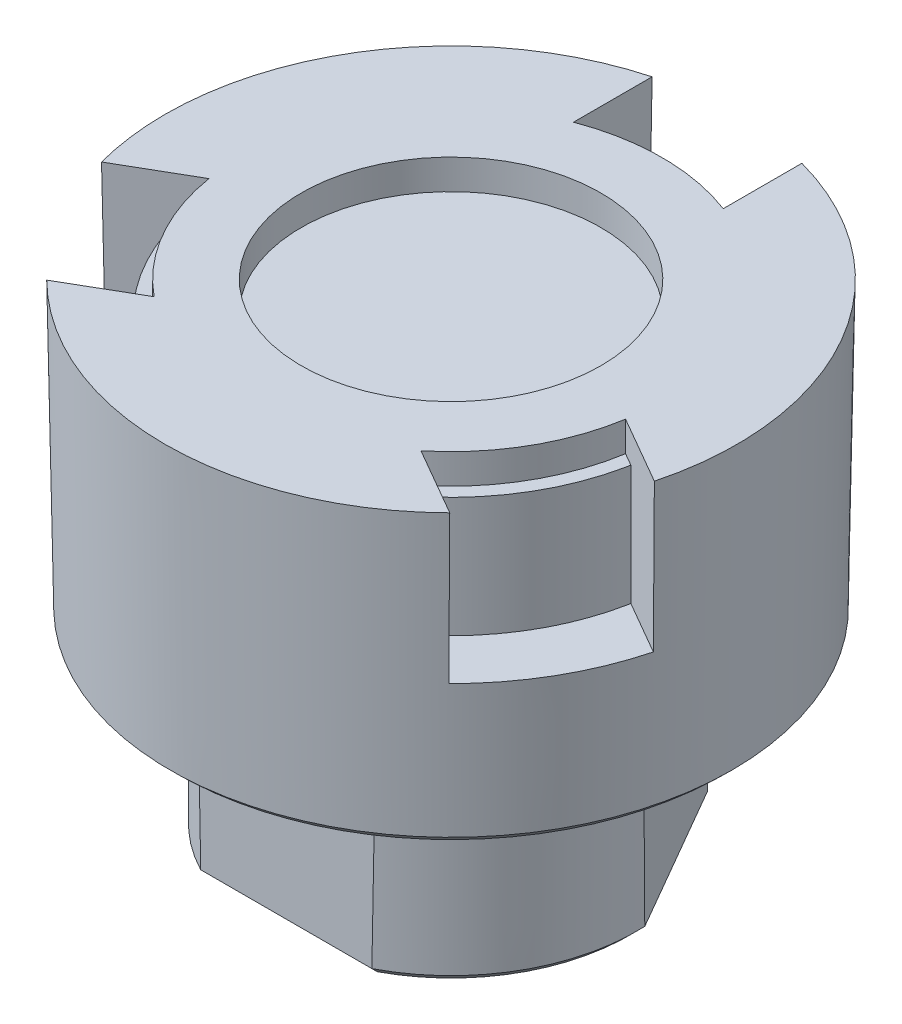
ISO-10303-21;
HEADER;
FILE_DESCRIPTION(('STEP AP214'),'2;1');
FILE_NAME('part.step','',(''),(''),'','','');
FILE_SCHEMA(('AUTOMOTIVE_DESIGN { 1 0 10303 214 1 1 1 1 }'));
ENDSEC;
DATA;
#1=APPLICATION_CONTEXT('core data for automotive mechanical design processes');
#2=APPLICATION_PROTOCOL_DEFINITION('international standard','automotive_design',2000,#1);
#3=PRODUCT_CONTEXT('',#1,'mechanical');
#4=PRODUCT('Part','Part','',(#3));
#5=PRODUCT_RELATED_PRODUCT_CATEGORY('part','',(#4));
#6=PRODUCT_DEFINITION_FORMATION('','',#4);
#7=PRODUCT_DEFINITION_CONTEXT('part definition',#1,'design');
#8=PRODUCT_DEFINITION('design','',#6,#7);
#9=PRODUCT_DEFINITION_SHAPE('','',#8);
#10=(LENGTH_UNIT() NAMED_UNIT(*) SI_UNIT(.MILLI.,.METRE.));
#11=(NAMED_UNIT(*) PLANE_ANGLE_UNIT() SI_UNIT($,.RADIAN.));
#12=(NAMED_UNIT(*) SI_UNIT($,.STERADIAN.) SOLID_ANGLE_UNIT());
#13=UNCERTAINTY_MEASURE_WITH_UNIT(LENGTH_MEASURE(1.E-05),#10,'distance_accuracy_value','');
#14=(GEOMETRIC_REPRESENTATION_CONTEXT(3) GLOBAL_UNCERTAINTY_ASSIGNED_CONTEXT((#13)) GLOBAL_UNIT_ASSIGNED_CONTEXT((#10,
#11,#12)) REPRESENTATION_CONTEXT('',''));
#15=CARTESIAN_POINT('',(0.,0.,0.));
#16=DIRECTION('',(0.,0.,1.));
#17=DIRECTION('',(1.,0.,0.));
#18=AXIS2_PLACEMENT_3D('',#15,#16,#17);
#19=CARTESIAN_POINT('',(0.,6.00000000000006,0.));
#20=DIRECTION('',(0.,-1.,0.));
#21=DIRECTION('',(1.,0.,0.));
#22=AXIS2_PLACEMENT_3D('',#19,#20,#21);
#23=PLANE('',#22);
#24=CARTESIAN_POINT('',(0.,6.00000000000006,0.));
#25=DIRECTION('',(0.,1.,0.));
#26=DIRECTION('',(-1.,0.,0.));
#27=AXIS2_PLACEMENT_3D('',#24,#25,#26);
#28=CIRCLE('',#27,3.);
#29=CARTESIAN_POINT('',(-3.00000000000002,6.00000000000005,0.));
#30=VERTEX_POINT('',#29);
#31=EDGE_CURVE('P0_E17',#30,#30,#28,.F.);
#32=ORIENTED_EDGE('',*,*,#31,.F.);
#33=EDGE_LOOP('',(#32));
#34=FACE_BOUND('',#33,.T.);
#35=ADVANCED_FACE('P0_F14',(#34),#23,.F.);
#36=CARTESIAN_POINT('',(0.,3.50000000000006,0.));
#37=DIRECTION('',(0.,1.,0.));
#38=DIRECTION('',(-1.,0.,0.));
#39=AXIS2_PLACEMENT_3D('',#36,#37,#38);
#40=CYLINDRICAL_SURFACE('',#39,3.);
#41=ORIENTED_EDGE('',*,*,#31,.T.);
#42=EDGE_LOOP('',(#41));
#43=FACE_BOUND('',#42,.T.);
#44=CARTESIAN_POINT('',(0.,3.50000000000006,0.));
#45=DIRECTION('',(0.,1.,0.));
#46=DIRECTION('',(-1.,0.,0.));
#47=AXIS2_PLACEMENT_3D('',#44,#45,#46);
#48=CIRCLE('',#47,3.);
#49=CARTESIAN_POINT('',(-3.00000000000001,3.50000000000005,0.));
#50=VERTEX_POINT('',#49);
#51=EDGE_CURVE('P0_E10',#50,#50,#48,.F.);
#52=ORIENTED_EDGE('',*,*,#51,.F.);
#53=EDGE_LOOP('',(#52));
#54=FACE_BOUND('',#53,.T.);
#55=ADVANCED_FACE('P0_F26',(#43,#54),#40,.T.);
#56=CARTESIAN_POINT('',(0.,3.50000000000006,0.));
#57=DIRECTION('',(0.,-1.,0.));
#58=DIRECTION('',(1.,0.,0.));
#59=AXIS2_PLACEMENT_3D('',#56,#57,#58);
#60=PLANE('',#59);
#61=ORIENTED_EDGE('',*,*,#51,.T.);
#62=EDGE_LOOP('',(#61));
#63=FACE_BOUND('',#62,.T.);
#64=ADVANCED_FACE('P0_F35',(#63),#60,.T.);
#65=CLOSED_SHELL('',(#35,#55,#64));
#66=MANIFOLD_SOLID_BREP('P0_B1',#65);
#67=CARTESIAN_POINT('',(0.,1.50000000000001,0.));
#68=DIRECTION('',(0.,1.,0.));
#69=DIRECTION('',(-1.,0.,0.));
#70=AXIS2_PLACEMENT_3D('',#67,#68,#69);
#71=CYLINDRICAL_SURFACE('',#70,0.899999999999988);
#72=CARTESIAN_POINT('',(0.,1.59999999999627,0.));
#73=DIRECTION('',(0.,-1.,0.));
#74=DIRECTION('',(1.,0.,0.));
#75=AXIS2_PLACEMENT_3D('',#72,#73,#74);
#76=CIRCLE('',#75,0.899999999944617);
#77=CARTESIAN_POINT('',(-0.73356103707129,1.6000000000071,-0.521429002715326));
#78=VERTEX_POINT('',#77);
#79=CARTESIAN_POINT('',(-0.521429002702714,1.59999999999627,-0.733561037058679));
#80=VERTEX_POINT('',#79);
#81=EDGE_CURVE('P1_E394',#78,#80,#76,.T.);
#82=ORIENTED_EDGE('',*,*,#81,.T.);
#83=DIRECTION('',(0.,1.,0.));
#84=VECTOR('',#83,1.);
#85=CARTESIAN_POINT('',(-0.521429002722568,1.5,-0.733561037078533));
#86=LINE('',#85,#84);
#87=CARTESIAN_POINT('',(-0.521429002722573,3.50000000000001,-0.733561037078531));
#88=VERTEX_POINT('',#87);
#89=EDGE_CURVE('P1_E386',#80,#88,#86,.T.);
#90=ORIENTED_EDGE('',*,*,#89,.T.);
#91=CARTESIAN_POINT('',(0.,3.50000000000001,0.));
#92=DIRECTION('',(0.,1.,0.));
#93=DIRECTION('',(-1.,0.,0.));
#94=AXIS2_PLACEMENT_3D('',#91,#92,#93);
#95=CIRCLE('',#94,0.899999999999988);
#96=CARTESIAN_POINT('',(-0.73356103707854,3.5,-0.52142900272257));
#97=VERTEX_POINT('',#96);
#98=EDGE_CURVE('P1_E19',#97,#88,#95,.F.);
#99=ORIENTED_EDGE('',*,*,#98,.F.);
#100=DIRECTION('',(0.,1.,0.));
#101=VECTOR('',#100,1.);
#102=CARTESIAN_POINT('',(-0.733561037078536,1.5,-0.521429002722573));
#103=LINE('',#102,#101);
#104=EDGE_CURVE('P1_E380',#97,#78,#103,.F.);
#105=ORIENTED_EDGE('',*,*,#104,.T.);
#106=EDGE_LOOP('',(#82,#90,#99,#105));
#107=FACE_BOUND('',#106,.T.);
#108=ADVANCED_FACE('P1_F16',(#107),#71,.F.);
#109=CARTESIAN_POINT('',(0.,1.50000000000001,0.));
#110=DIRECTION('',(0.,1.,0.));
#111=DIRECTION('',(-1.,0.,0.));
#112=AXIS2_PLACEMENT_3D('',#109,#110,#111);
#113=CYLINDRICAL_SURFACE('',#112,0.899999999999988);
#114=CARTESIAN_POINT('',(0.,1.59999999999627,0.));
#115=DIRECTION('',(0.,-1.,0.));
#116=DIRECTION('',(1.,0.,0.));
#117=AXIS2_PLACEMENT_3D('',#114,#115,#116);
#118=CIRCLE('',#117,0.900000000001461);
#119=CARTESIAN_POINT('',(-0.149999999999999,1.599999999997,-0.887411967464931));
#120=VERTEX_POINT('',#119);
#121=CARTESIAN_POINT('',(0.150000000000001,1.59999999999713,-0.887411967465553));
#122=VERTEX_POINT('',#121);
#123=EDGE_CURVE('P1_E713',#120,#122,#118,.T.);
#124=ORIENTED_EDGE('',*,*,#123,.T.);
#125=DIRECTION('',(0.,1.,0.));
#126=VECTOR('',#125,1.);
#127=CARTESIAN_POINT('',(0.150000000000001,1.50000000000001,-0.887411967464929));
#128=LINE('',#127,#126);
#129=CARTESIAN_POINT('',(0.149999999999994,3.50000000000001,-0.887411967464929));
#130=VERTEX_POINT('',#129);
#131=EDGE_CURVE('P1_E666',#122,#130,#128,.T.);
#132=ORIENTED_EDGE('',*,*,#131,.T.);
#133=CARTESIAN_POINT('',(0.,3.50000000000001,0.));
#134=DIRECTION('',(0.,1.,0.));
#135=DIRECTION('',(-1.,0.,0.));
#136=AXIS2_PLACEMENT_3D('',#133,#134,#135);
#137=CIRCLE('',#136,0.899999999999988);
#138=CARTESIAN_POINT('',(-0.150000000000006,3.50000000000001,-0.887411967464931));
#139=VERTEX_POINT('',#138);
#140=EDGE_CURVE('P1_E388',#139,#130,#137,.F.);
#141=ORIENTED_EDGE('',*,*,#140,.F.);
#142=DIRECTION('',(0.,1.,0.));
#143=VECTOR('',#142,1.);
#144=CARTESIAN_POINT('',(-0.149999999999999,1.50000000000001,-0.887411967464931));
#145=LINE('',#144,#143);
#146=EDGE_CURVE('P1_E719',#139,#120,#145,.F.);
#147=ORIENTED_EDGE('',*,*,#146,.T.);
#148=EDGE_LOOP('',(#124,#132,#141,#147));
#149=FACE_BOUND('',#148,.T.);
#150=ADVANCED_FACE('P1_F756',(#149),#113,.F.);
#151=CARTESIAN_POINT('',(0.,1.50000000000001,0.));
#152=DIRECTION('',(0.,1.,0.));
#153=DIRECTION('',(-1.,0.,0.));
#154=AXIS2_PLACEMENT_3D('',#151,#152,#153);
#155=CYLINDRICAL_SURFACE('',#154,0.899999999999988);
#156=CARTESIAN_POINT('',(0.,1.59999999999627,0.));
#157=DIRECTION('',(0.,-1.,0.));
#158=DIRECTION('',(1.,0.,0.));
#159=AXIS2_PLACEMENT_3D('',#156,#157,#158);
#160=CIRCLE('',#159,0.899999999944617);
#161=CARTESIAN_POINT('',(0.521429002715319,1.60000000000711,-0.733561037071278));
#162=VERTEX_POINT('',#161);
#163=CARTESIAN_POINT('',(0.733561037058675,1.59999999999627,-0.521429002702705));
#164=VERTEX_POINT('',#163);
#165=EDGE_CURVE('P1_E657',#162,#164,#160,.T.);
#166=ORIENTED_EDGE('',*,*,#165,.T.);
#167=DIRECTION('',(0.,1.,0.));
#168=VECTOR('',#167,1.);
#169=CARTESIAN_POINT('',(0.733561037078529,1.50000000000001,-0.52142900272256));
#170=LINE('',#169,#168);
#171=CARTESIAN_POINT('',(0.733561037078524,3.50000000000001,-0.521429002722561));
#172=VERTEX_POINT('',#171);
#173=EDGE_CURVE('P1_E734',#164,#172,#170,.T.);
#174=ORIENTED_EDGE('',*,*,#173,.T.);
#175=CARTESIAN_POINT('',(0.,3.50000000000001,0.));
#176=DIRECTION('',(0.,1.,0.));
#177=DIRECTION('',(-1.,0.,0.));
#178=AXIS2_PLACEMENT_3D('',#175,#176,#177);
#179=CIRCLE('',#178,0.899999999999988);
#180=CARTESIAN_POINT('',(0.52142900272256,3.50000000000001,-0.733561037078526));
#181=VERTEX_POINT('',#180);
#182=EDGE_CURVE('P1_E381',#181,#172,#179,.F.);
#183=ORIENTED_EDGE('',*,*,#182,.F.);
#184=DIRECTION('',(0.,1.,0.));
#185=VECTOR('',#184,1.);
#186=CARTESIAN_POINT('',(0.521429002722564,1.50000000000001,-0.733561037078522));
#187=LINE('',#186,#185);
#188=EDGE_CURVE('P1_E658',#181,#162,#187,.F.);
#189=ORIENTED_EDGE('',*,*,#188,.T.);
#190=EDGE_LOOP('',(#166,#174,#183,#189));
#191=FACE_BOUND('',#190,.T.);
#192=ADVANCED_FACE('P1_F790',(#191),#155,.F.);
#193=CARTESIAN_POINT('',(-0.805172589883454,1.5,-0.593040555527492));
#194=DIRECTION('',(0.707106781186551,0.,-0.707106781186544));
#195=DIRECTION('',(-0.707106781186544,0.,-0.707106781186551));
#196=AXIS2_PLACEMENT_3D('',#193,#194,#195);
#197=PLANE('',#196);
#198=CARTESIAN_POINT('',(-0.805172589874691,1.50000000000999,-0.593040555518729));
#199=CARTESIAN_POINT('',(-0.793245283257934,1.51667805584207,-0.581113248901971));
#200=CARTESIAN_POINT('',(-0.781314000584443,1.53335041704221,-0.569181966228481));
#201=CARTESIAN_POINT('',(-0.757443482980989,1.56668375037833,-0.545311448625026));
#202=CARTESIAN_POINT('',(-0.74550424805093,1.58334472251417,-0.533372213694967));
#203=CARTESIAN_POINT('',(-0.733561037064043,1.60000000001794,-0.52142900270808));
#204=B_SPLINE_CURVE_WITH_KNOTS('',3,(#198,#199,#200,#201,#202,#203),.UNSPECIFIED.,.F.,.F.,(4,2,
4),(0.,0.0711625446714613,0.142325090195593),.UNSPECIFIED.);
#205=CARTESIAN_POINT('',(-0.805172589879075,1.50000000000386,-0.593040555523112));
#206=VERTEX_POINT('',#205);
#207=EDGE_CURVE('P1_E391',#206,#78,#204,.T.);
#208=ORIENTED_EDGE('',*,*,#207,.T.);
#209=ORIENTED_EDGE('',*,*,#104,.F.);
#210=DIRECTION('',(-0.707106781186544,0.,-0.707106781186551));
#211=VECTOR('',#210,1.);
#212=CARTESIAN_POINT('',(-0.805172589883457,3.5,-0.593040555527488));
#213=LINE('',#212,#211);
#214=CARTESIAN_POINT('',(-0.805172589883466,3.50000000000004,-0.593040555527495));
#215=VERTEX_POINT('',#214);
#216=EDGE_CURVE('P1_E370',#215,#97,#213,.F.);
#217=ORIENTED_EDGE('',*,*,#216,.F.);
#218=DIRECTION('',(0.,-1.,0.));
#219=VECTOR('',#218,1.);
#220=CARTESIAN_POINT('',(-0.805172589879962,-1000.,-0.593040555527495));
#221=LINE('',#220,#219);
#222=EDGE_CURVE('P1_E728',#215,#206,#221,.T.);
#223=ORIENTED_EDGE('',*,*,#222,.T.);
#224=EDGE_LOOP('',(#208,#209,#217,#223));
#225=FACE_BOUND('',#224,.T.);
#226=ADVANCED_FACE('P1_F389',(#225),#197,.F.);
#227=CARTESIAN_POINT('',(0.,1.50000000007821,0.));
#228=DIRECTION('',(0.,-1.,0.));
#229=DIRECTION('',(1.,0.,0.));
#230=AXIS2_PLACEMENT_3D('',#227,#228,#229);
#231=CONICAL_SURFACE('',#230,0.999999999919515,0.785398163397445);
#232=ORIENTED_EDGE('',*,*,#81,.F.);
#233=ORIENTED_EDGE('',*,*,#207,.F.);
#234=CARTESIAN_POINT('',(0.,1.50000000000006,0.));
#235=DIRECTION('',(0.,-1.,0.));
#236=DIRECTION('',(1.,0.,0.));
#237=AXIS2_PLACEMENT_3D('',#234,#235,#236);
#238=CIRCLE('',#237,0.999999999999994);
#239=CARTESIAN_POINT('',(-0.593040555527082,1.49999999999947,-0.805172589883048));
#240=VERTEX_POINT('',#239);
#241=EDGE_CURVE('P1_E723',#206,#240,#238,.T.);
#242=ORIENTED_EDGE('',*,*,#241,.T.);
#243=CARTESIAN_POINT('',(-0.593040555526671,1.49999999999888,-0.805172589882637));
#244=CARTESIAN_POINT('',(-0.581113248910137,1.51667805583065,-0.793245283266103));
#245=CARTESIAN_POINT('',(-0.569181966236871,1.53335041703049,-0.781314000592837));
#246=CARTESIAN_POINT('',(-0.545311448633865,1.56668375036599,-0.757443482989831));
#247=CARTESIAN_POINT('',(-0.533372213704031,1.58334472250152,-0.745504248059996));
#248=CARTESIAN_POINT('',(-0.521429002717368,1.60000000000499,-0.733561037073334));
#249=B_SPLINE_CURVE_WITH_KNOTS('',3,(#243,#244,#245,#246,#247,#248),.UNSPECIFIED.,.F.,.F.,(4,2,
4),(0.,0.0711625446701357,0.142325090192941),.UNSPECIFIED.);
#250=EDGE_CURVE('P1_E726',#240,#80,#249,.T.);
#251=ORIENTED_EDGE('',*,*,#250,.T.);
#252=EDGE_LOOP('',(#232,#233,#242,#251));
#253=FACE_BOUND('',#252,.T.);
#254=ADVANCED_FACE('P1_F743',(#253),#231,.F.);
#255=CARTESIAN_POINT('',(-0.593040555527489,1.5,-0.805172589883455));
#256=DIRECTION('',(-0.707106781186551,0.,0.707106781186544));
#257=DIRECTION('',(0.707106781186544,0.,0.707106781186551));
#258=AXIS2_PLACEMENT_3D('',#255,#256,#257);
#259=PLANE('',#258);
#260=ORIENTED_EDGE('',*,*,#250,.F.);
#261=DIRECTION('',(0.,-1.,0.));
#262=VECTOR('',#261,1.);
#263=CARTESIAN_POINT('',(-0.593040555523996,-1000.,-0.805172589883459));
#264=LINE('',#263,#262);
#265=CARTESIAN_POINT('',(-0.5930405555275,3.50000000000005,-0.805172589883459));
#266=VERTEX_POINT('',#265);
#267=EDGE_CURVE('P1_E720',#240,#266,#264,.F.);
#268=ORIENTED_EDGE('',*,*,#267,.T.);
#269=DIRECTION('',(0.707106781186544,0.,0.707106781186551));
#270=VECTOR('',#269,1.);
#271=CARTESIAN_POINT('',(-0.593040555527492,3.5,-0.805172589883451));
#272=LINE('',#271,#270);
#273=EDGE_CURVE('P1_E724',#88,#266,#272,.F.);
#274=ORIENTED_EDGE('',*,*,#273,.F.);
#275=ORIENTED_EDGE('',*,*,#89,.F.);
#276=EDGE_LOOP('',(#260,#268,#274,#275));
#277=FACE_BOUND('',#276,.T.);
#278=ADVANCED_FACE('P1_F747',(#277),#259,.F.);
#279=CARTESIAN_POINT('',(-0.149999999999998,1.50000000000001,-0.988685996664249));
#280=DIRECTION('',(1.,0.,0.));
#281=DIRECTION('',(0.,0.,-1.));
#282=AXIS2_PLACEMENT_3D('',#279,#280,#281);
#283=PLANE('',#282);
#284=CARTESIAN_POINT('',(-0.150000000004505,1.50000000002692,-0.988685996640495));
#285=CARTESIAN_POINT('',(-0.150000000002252,1.51667805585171,-0.971818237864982));
#286=CARTESIAN_POINT('',(-0.15000000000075,1.53335041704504,-0.954944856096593));
#287=CARTESIAN_POINT('',(-0.149999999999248,1.56668375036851,-0.921186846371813));
#288=CARTESIAN_POINT('',(-0.149999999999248,1.58334472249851,-0.904302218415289));
#289=CARTESIAN_POINT('',(-0.149999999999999,1.59999999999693,-0.887411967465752));
#290=B_SPLINE_CURVE_WITH_KNOTS('',3,(#284,#285,#286,#287,#288,#289),.UNSPECIFIED.,.F.,.F.,(4,2,
4),(0.,0.0711625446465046,0.14232509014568),.UNSPECIFIED.);
#291=CARTESIAN_POINT('',(-0.149999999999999,1.50000000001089,-0.98868599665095));
#292=VERTEX_POINT('',#291);
#293=EDGE_CURVE('P1_E668',#292,#120,#290,.T.);
#294=ORIENTED_EDGE('',*,*,#293,.T.);
#295=ORIENTED_EDGE('',*,*,#146,.F.);
#296=DIRECTION('',(0.,0.,-1.));
#297=VECTOR('',#296,1.);
#298=CARTESIAN_POINT('',(-0.150000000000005,3.50000000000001,-0.988685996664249));
#299=LINE('',#298,#297);
#300=CARTESIAN_POINT('',(-0.150000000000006,3.50000000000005,-0.988685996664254));
#301=VERTEX_POINT('',#300);
#302=EDGE_CURVE('P1_E717',#301,#139,#299,.F.);
#303=ORIENTED_EDGE('',*,*,#302,.F.);
#304=DIRECTION('',(0.,-1.,0.));
#305=VECTOR('',#304,1.);
#306=CARTESIAN_POINT('',(-0.149999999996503,-1000.,-0.988685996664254));
#307=LINE('',#306,#305);
#308=EDGE_CURVE('P1_E707',#301,#292,#307,.T.);
#309=ORIENTED_EDGE('',*,*,#308,.T.);
#310=EDGE_LOOP('',(#294,#295,#303,#309));
#311=FACE_BOUND('',#310,.T.);
#312=ADVANCED_FACE('P1_F686',(#311),#283,.F.);
#313=CARTESIAN_POINT('',(0.,1.50000000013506,0.));
#314=DIRECTION('',(0.,-1.,0.));
#315=DIRECTION('',(1.,0.,0.));
#316=AXIS2_PLACEMENT_3D('',#313,#314,#315);
#317=CONICAL_SURFACE('',#316,0.999999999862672,0.785398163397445);
#318=ORIENTED_EDGE('',*,*,#123,.F.);
#319=ORIENTED_EDGE('',*,*,#293,.F.);
#320=CARTESIAN_POINT('',(0.,1.50000000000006,0.));
#321=DIRECTION('',(0.,-1.,0.));
#322=DIRECTION('',(1.,0.,0.));
#323=AXIS2_PLACEMENT_3D('',#320,#321,#322);
#324=CIRCLE('',#323,0.999999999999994);
#325=CARTESIAN_POINT('',(0.150000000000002,1.49999999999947,-0.988685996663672));
#326=VERTEX_POINT('',#325);
#327=EDGE_CURVE('P1_E701',#292,#326,#324,.T.);
#328=ORIENTED_EDGE('',*,*,#327,.T.);
#329=CARTESIAN_POINT('',(0.150000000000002,1.49999999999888,-0.988685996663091));
#330=CARTESIAN_POINT('',(0.150000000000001,1.51667805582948,-0.971818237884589));
#331=CARTESIAN_POINT('',(0.150000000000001,1.53335041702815,-0.954944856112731));
#332=CARTESIAN_POINT('',(0.150000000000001,1.56668375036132,-0.921186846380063));
#333=CARTESIAN_POINT('',(0.150000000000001,1.58334472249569,-0.904302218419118));
#334=CARTESIAN_POINT('',(0.150000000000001,1.59999999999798,-0.887411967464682));
#335=B_SPLINE_CURVE_WITH_KNOTS('',3,(#329,#330,#331,#332,#333,#334),.UNSPECIFIED.,.F.,.F.,(4,2,
4),(0.,0.0711625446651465,0.142325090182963),.UNSPECIFIED.);
#336=EDGE_CURVE('P1_E659',#326,#122,#335,.T.);
#337=ORIENTED_EDGE('',*,*,#336,.T.);
#338=EDGE_LOOP('',(#318,#319,#328,#337));
#339=FACE_BOUND('',#338,.T.);
#340=ADVANCED_FACE('P1_F674',(#339),#317,.F.);
#341=CARTESIAN_POINT('',(0.150000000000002,1.50000000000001,-0.988685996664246));
#342=DIRECTION('',(-1.,0.,0.));
#343=DIRECTION('',(0.,0.,1.));
#344=AXIS2_PLACEMENT_3D('',#341,#342,#343);
#345=PLANE('',#344);
#346=ORIENTED_EDGE('',*,*,#336,.F.);
#347=DIRECTION('',(0.,-1.,0.));
#348=VECTOR('',#347,1.);
#349=CARTESIAN_POINT('',(0.1500000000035,-1000.,-0.988685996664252));
#350=LINE('',#349,#348);
#351=CARTESIAN_POINT('',(0.149999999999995,3.50000000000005,-0.988685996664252));
#352=VERTEX_POINT('',#351);
#353=EDGE_CURVE('P1_E693',#326,#352,#350,.F.);
#354=ORIENTED_EDGE('',*,*,#353,.T.);
#355=DIRECTION('',(0.,0.,1.));
#356=VECTOR('',#355,1.);
#357=CARTESIAN_POINT('',(0.149999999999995,3.50000000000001,-0.988685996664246));
#358=LINE('',#357,#356);
#359=EDGE_CURVE('P1_E667',#130,#352,#358,.F.);
#360=ORIENTED_EDGE('',*,*,#359,.F.);
#361=ORIENTED_EDGE('',*,*,#131,.F.);
#362=EDGE_LOOP('',(#346,#354,#360,#361));
#363=FACE_BOUND('',#362,.T.);
#364=ADVANCED_FACE('P1_F676',(#363),#345,.F.);
#365=CARTESIAN_POINT('',(0.593040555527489,1.50000000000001,-0.805172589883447));
#366=DIRECTION('',(0.707106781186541,0.,0.707106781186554));
#367=DIRECTION('',(0.707106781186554,0.,-0.707106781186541));
#368=AXIS2_PLACEMENT_3D('',#365,#366,#367);
#369=PLANE('',#368);
#370=CARTESIAN_POINT('',(0.593040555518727,1.50000000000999,-0.805172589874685));
#371=CARTESIAN_POINT('',(0.581113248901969,1.51667805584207,-0.793245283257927));
#372=CARTESIAN_POINT('',(0.569181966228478,1.53335041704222,-0.781314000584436));
#373=CARTESIAN_POINT('',(0.545311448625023,1.56668375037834,-0.757443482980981));
#374=CARTESIAN_POINT('',(0.533372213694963,1.58334472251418,-0.745504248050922));
#375=CARTESIAN_POINT('',(0.521429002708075,1.60000000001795,-0.733561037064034));
#376=B_SPLINE_CURVE_WITH_KNOTS('',3,(#370,#371,#372,#373,#374,#375),.UNSPECIFIED.,.F.,.F.,(4,2,
4),(0.,0.0711625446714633,0.142325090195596),.UNSPECIFIED.);
#377=CARTESIAN_POINT('',(0.59304055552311,1.50000000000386,-0.805172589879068));
#378=VERTEX_POINT('',#377);
#379=EDGE_CURVE('P1_E651',#378,#162,#376,.T.);
#380=ORIENTED_EDGE('',*,*,#379,.T.);
#381=ORIENTED_EDGE('',*,*,#188,.F.);
#382=DIRECTION('',(0.707106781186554,0.,-0.707106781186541));
#383=VECTOR('',#382,1.);
#384=CARTESIAN_POINT('',(0.593040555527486,3.50000000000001,-0.80517258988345));
#385=LINE('',#384,#383);
#386=CARTESIAN_POINT('',(0.593040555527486,3.50000000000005,-0.805172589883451));
#387=VERTEX_POINT('',#386);
#388=EDGE_CURVE('P1_E711',#387,#181,#385,.F.);
#389=ORIENTED_EDGE('',*,*,#388,.F.);
#390=DIRECTION('',(0.,-1.,0.));
#391=VECTOR('',#390,1.);
#392=CARTESIAN_POINT('',(0.593040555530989,-1000.,-0.805172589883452));
#393=LINE('',#392,#391);
#394=EDGE_CURVE('P1_E705',#387,#378,#393,.T.);
#395=ORIENTED_EDGE('',*,*,#394,.T.);
#396=EDGE_LOOP('',(#380,#381,#389,#395));
#397=FACE_BOUND('',#396,.T.);
#398=ADVANCED_FACE('P1_F646',(#397),#369,.F.);
#399=CARTESIAN_POINT('',(0.,1.50000000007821,0.));
#400=DIRECTION('',(0.,-1.,0.));
#401=DIRECTION('',(1.,0.,0.));
#402=AXIS2_PLACEMENT_3D('',#399,#400,#401);
#403=CONICAL_SURFACE('',#402,0.999999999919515,0.785398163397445);
#404=ORIENTED_EDGE('',*,*,#165,.F.);
#405=ORIENTED_EDGE('',*,*,#379,.F.);
#406=CARTESIAN_POINT('',(0.,1.50000000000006,0.));
#407=DIRECTION('',(0.,-1.,0.));
#408=DIRECTION('',(1.,0.,0.));
#409=AXIS2_PLACEMENT_3D('',#406,#407,#408);
#410=CIRCLE('',#409,0.999999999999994);
#411=CARTESIAN_POINT('',(0.805172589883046,1.49999999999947,-0.593040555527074));
#412=VERTEX_POINT('',#411);
#413=EDGE_CURVE('P1_E809',#378,#412,#410,.T.);
#414=ORIENTED_EDGE('',*,*,#413,.T.);
#415=CARTESIAN_POINT('',(0.805172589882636,1.49999999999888,-0.593040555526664));
#416=CARTESIAN_POINT('',(0.793245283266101,1.51667805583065,-0.58111324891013));
#417=CARTESIAN_POINT('',(0.781314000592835,1.53335041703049,-0.569181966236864));
#418=CARTESIAN_POINT('',(0.757443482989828,1.56668375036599,-0.545311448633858));
#419=CARTESIAN_POINT('',(0.745504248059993,1.58334472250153,-0.533372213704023));
#420=CARTESIAN_POINT('',(0.733561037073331,1.60000000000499,-0.521429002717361));
#421=B_SPLINE_CURVE_WITH_KNOTS('',3,(#415,#416,#417,#418,#419,#420),.UNSPECIFIED.,.F.,.F.,(4,2,
4),(0.,0.0711625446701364,0.142325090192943),.UNSPECIFIED.);
#422=EDGE_CURVE('P1_E623',#412,#164,#421,.T.);
#423=ORIENTED_EDGE('',*,*,#422,.T.);
#424=EDGE_LOOP('',(#404,#405,#414,#423));
#425=FACE_BOUND('',#424,.T.);
#426=ADVANCED_FACE('P1_F641',(#425),#403,.F.);
#427=CARTESIAN_POINT('',(0.805172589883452,1.50000000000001,-0.593040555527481));
#428=DIRECTION('',(-0.707106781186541,0.,-0.707106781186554));
#429=DIRECTION('',(-0.707106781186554,0.,0.707106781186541));
#430=AXIS2_PLACEMENT_3D('',#427,#428,#429);
#431=PLANE('',#430);
#432=ORIENTED_EDGE('',*,*,#422,.F.);
#433=DIRECTION('',(0.,-1.,0.));
#434=VECTOR('',#433,1.);
#435=CARTESIAN_POINT('',(0.805172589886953,-1000.,-0.593040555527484));
#436=LINE('',#435,#434);
#437=CARTESIAN_POINT('',(0.805172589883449,3.50000000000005,-0.593040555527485));
#438=VERTEX_POINT('',#437);
#439=EDGE_CURVE('P1_E812',#412,#438,#436,.F.);
#440=ORIENTED_EDGE('',*,*,#439,.T.);
#441=DIRECTION('',(-0.707106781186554,0.,0.707106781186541));
#442=VECTOR('',#441,1.);
#443=CARTESIAN_POINT('',(0.805172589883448,3.50000000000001,-0.593040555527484));
#444=LINE('',#443,#442);
#445=EDGE_CURVE('P1_E733',#172,#438,#444,.F.);
#446=ORIENTED_EDGE('',*,*,#445,.F.);
#447=ORIENTED_EDGE('',*,*,#173,.F.);
#448=EDGE_LOOP('',(#432,#440,#446,#447));
#449=FACE_BOUND('',#448,.T.);
#450=ADVANCED_FACE('P1_F635',(#449),#431,.F.);
#451=CARTESIAN_POINT('',(-0.988685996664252,1.5,-0.150000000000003));
#452=DIRECTION('',(0.,0.,1.));
#453=DIRECTION('',(1.,0.,0.));
#454=AXIS2_PLACEMENT_3D('',#451,#452,#453);
#455=PLANE('',#454);
#456=CARTESIAN_POINT('',(-0.988685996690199,1.50000000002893,-0.150000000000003));
#457=CARTESIAN_POINT('',(-0.971818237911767,1.51667805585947,-0.150000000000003));
#458=CARTESIAN_POINT('',(-0.954944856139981,1.53335041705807,-0.150000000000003));
#459=CARTESIAN_POINT('',(-0.921186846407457,1.56668375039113,-0.150000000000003));
#460=CARTESIAN_POINT('',(-0.904302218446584,1.58334472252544,-0.150000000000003));
#461=CARTESIAN_POINT('',(-0.887411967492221,1.60000000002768,-0.150000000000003));
#462=B_SPLINE_CURVE_WITH_KNOTS('',3,(#456,#457,#458,#459,#460,#461),.UNSPECIFIED.,.F.,.F.,(4,2,
4),(0.,0.0711625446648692,0.142325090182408),.UNSPECIFIED.);
#463=CARTESIAN_POINT('',(-0.988685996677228,1.50000000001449,-0.150000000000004));
#464=VERTEX_POINT('',#463);
#465=CARTESIAN_POINT('',(-0.887411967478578,1.60000000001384,-0.150000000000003));
#466=VERTEX_POINT('',#465);
#467=EDGE_CURVE('P1_E612',#464,#466,#462,.T.);
#468=ORIENTED_EDGE('',*,*,#467,.F.);
#469=DIRECTION('',(0.,-1.,0.));
#470=VECTOR('',#469,1.);
#471=CARTESIAN_POINT('',(-0.988685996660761,-1000.,-0.150000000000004));
#472=LINE('',#471,#470);
#473=CARTESIAN_POINT('',(-0.988685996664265,3.50000000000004,-0.150000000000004));
#474=VERTEX_POINT('',#473);
#475=EDGE_CURVE('P1_E620',#464,#474,#472,.F.);
#476=ORIENTED_EDGE('',*,*,#475,.T.);
#477=DIRECTION('',(1.,0.,0.));
#478=VECTOR('',#477,1.);
#479=CARTESIAN_POINT('',(-0.988685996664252,3.5,-0.150000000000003));
#480=LINE('',#479,#478);
#481=CARTESIAN_POINT('',(-0.887411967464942,3.5,-0.150000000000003));
#482=VERTEX_POINT('',#481);
#483=EDGE_CURVE('P1_E621',#482,#474,#480,.F.);
#484=ORIENTED_EDGE('',*,*,#483,.F.);
#485=DIRECTION('',(0.,1.,0.));
#486=VECTOR('',#485,1.);
#487=CARTESIAN_POINT('',(-0.887411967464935,1.5,-0.150000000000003));
#488=LINE('',#487,#486);
#489=EDGE_CURVE('P1_E834',#482,#466,#488,.F.);
#490=ORIENTED_EDGE('',*,*,#489,.T.);
#491=EDGE_LOOP('',(#468,#476,#484,#490));
#492=FACE_BOUND('',#491,.T.);
#493=ADVANCED_FACE('P1_F630',(#492),#455,.F.);
#494=CARTESIAN_POINT('',(0.988685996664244,1.50000000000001,-0.14999999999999));
#495=DIRECTION('',(0.,0.,1.));
#496=DIRECTION('',(1.,0.,0.));
#497=AXIS2_PLACEMENT_3D('',#494,#495,#496);
#498=PLANE('',#497);
#499=CARTESIAN_POINT('',(0.988685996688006,1.5000000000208,-0.149999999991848));
#500=CARTESIAN_POINT('',(0.971818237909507,1.51667805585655,-0.149999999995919));
#501=CARTESIAN_POINT('',(0.954944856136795,1.53335041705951,-0.149999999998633));
#502=CARTESIAN_POINT('',(0.921186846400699,1.56668375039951,-0.150000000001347));
#503=CARTESIAN_POINT('',(0.904302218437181,1.58334472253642,-0.150000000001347));
#504=CARTESIAN_POINT('',(0.887411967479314,1.6000000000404,-0.149999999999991));
#505=B_SPLINE_CURVE_WITH_KNOTS('',3,(#499,#500,#501,#502,#503,#504),.UNSPECIFIED.,.F.,.F.,(4,2,
4),(0.,0.0711625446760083,0.142325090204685),.UNSPECIFIED.);
#506=CARTESIAN_POINT('',(0.988685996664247,1.50000000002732,-0.14999999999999));
#507=VERTEX_POINT('',#506);
#508=CARTESIAN_POINT('',(0.887411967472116,1.60000000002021,-0.149999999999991));
#509=VERTEX_POINT('',#508);
#510=EDGE_CURVE('P1_E826',#507,#509,#505,.T.);
#511=ORIENTED_EDGE('',*,*,#510,.T.);
#512=DIRECTION('',(0.,1.,0.));
#513=VECTOR('',#512,1.);
#514=CARTESIAN_POINT('',(0.887411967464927,1.50000000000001,-0.14999999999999));
#515=LINE('',#514,#513);
#516=CARTESIAN_POINT('',(0.88741196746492,3.50000000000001,-0.149999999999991));
#517=VERTEX_POINT('',#516);
#518=EDGE_CURVE('P1_E875',#509,#517,#515,.T.);
#519=ORIENTED_EDGE('',*,*,#518,.T.);
#520=DIRECTION('',(1.,0.,0.));
#521=VECTOR('',#520,1.);
#522=CARTESIAN_POINT('',(0.988685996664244,3.50000000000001,-0.14999999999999));
#523=LINE('',#522,#521);
#524=CARTESIAN_POINT('',(0.988685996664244,3.50000000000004,-0.14999999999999));
#525=VERTEX_POINT('',#524);
#526=EDGE_CURVE('P1_E821',#525,#517,#523,.F.);
#527=ORIENTED_EDGE('',*,*,#526,.F.);
#528=DIRECTION('',(0.,1.,0.));
#529=VECTOR('',#528,1.);
#530=CARTESIAN_POINT('',(0.988685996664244,1.50000000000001,-0.14999999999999));
#531=LINE('',#530,#529);
#532=EDGE_CURVE('P1_E823',#507,#525,#531,.T.);
#533=ORIENTED_EDGE('',*,*,#532,.F.);
#534=EDGE_LOOP('',(#511,#519,#527,#533));
#535=FACE_BOUND('',#534,.T.);
#536=ADVANCED_FACE('P1_F634',(#535),#498,.F.);
#537=CARTESIAN_POINT('',(0.,1.50000000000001,0.));
#538=DIRECTION('',(0.,1.,0.));
#539=DIRECTION('',(-1.,0.,0.));
#540=AXIS2_PLACEMENT_3D('',#537,#538,#539);
#541=CYLINDRICAL_SURFACE('',#540,0.899999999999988);
#542=ORIENTED_EDGE('',*,*,#518,.F.);
#543=CARTESIAN_POINT('',(0.,1.60000000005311,0.));
#544=DIRECTION('',(0.,-1.,0.));
#545=DIRECTION('',(1.,0.,0.));
#546=AXIS2_PLACEMENT_3D('',#543,#544,#545);
#547=CIRCLE('',#546,0.900000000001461);
#548=CARTESIAN_POINT('',(0.88741196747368,1.60000000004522,0.150000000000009));
#549=VERTEX_POINT('',#548);
#550=EDGE_CURVE('P1_E867',#509,#549,#547,.T.);
#551=ORIENTED_EDGE('',*,*,#550,.T.);
#552=DIRECTION('',(0.,1.,0.));
#553=VECTOR('',#552,1.);
#554=CARTESIAN_POINT('',(0.887411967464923,1.50000000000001,0.150000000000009));
#555=LINE('',#554,#553);
#556=CARTESIAN_POINT('',(0.88741196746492,3.50000000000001,0.150000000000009));
#557=VERTEX_POINT('',#556);
#558=EDGE_CURVE('P1_E856',#549,#557,#555,.T.);
#559=ORIENTED_EDGE('',*,*,#558,.T.);
#560=CARTESIAN_POINT('',(0.,3.50000000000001,0.));
#561=DIRECTION('',(0.,1.,0.));
#562=DIRECTION('',(-1.,0.,0.));
#563=AXIS2_PLACEMENT_3D('',#560,#561,#562);
#564=CIRCLE('',#563,0.899999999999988);
#565=EDGE_CURVE('P1_E833',#517,#557,#564,.F.);
#566=ORIENTED_EDGE('',*,*,#565,.F.);
#567=EDGE_LOOP('',(#542,#551,#559,#566));
#568=FACE_BOUND('',#567,.T.);
#569=ADVANCED_FACE('P1_F981',(#568),#541,.F.);
#570=CARTESIAN_POINT('',(0.,1.50000000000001,0.));
#571=DIRECTION('',(0.,1.,0.));
#572=DIRECTION('',(-1.,0.,0.));
#573=AXIS2_PLACEMENT_3D('',#570,#571,#572);
#574=CYLINDRICAL_SURFACE('',#573,0.899999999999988);
#575=CARTESIAN_POINT('',(0.,1.59999999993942,0.));
#576=DIRECTION('',(0.,-1.,0.));
#577=DIRECTION('',(1.,0.,0.));
#578=AXIS2_PLACEMENT_3D('',#575,#576,#577);
#579=CIRCLE('',#578,0.900000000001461);
#580=CARTESIAN_POINT('',(0.733561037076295,1.59999999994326,0.521429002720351));
#581=VERTEX_POINT('',#580);
#582=CARTESIAN_POINT('',(0.521429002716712,1.59999999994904,0.733561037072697));
#583=VERTEX_POINT('',#582);
#584=EDGE_CURVE('P1_E940',#581,#583,#579,.T.);
#585=ORIENTED_EDGE('',*,*,#584,.T.);
#586=DIRECTION('',(0.,1.,0.));
#587=VECTOR('',#586,1.);
#588=CARTESIAN_POINT('',(0.521429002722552,1.50000000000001,0.733561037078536));
#589=LINE('',#588,#587);
#590=CARTESIAN_POINT('',(0.521429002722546,3.50000000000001,0.733561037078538));
#591=VERTEX_POINT('',#590);
#592=EDGE_CURVE('P1_E936',#583,#591,#589,.T.);
#593=ORIENTED_EDGE('',*,*,#592,.T.);
#594=CARTESIAN_POINT('',(0.,3.50000000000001,0.));
#595=DIRECTION('',(0.,1.,0.));
#596=DIRECTION('',(-1.,0.,0.));
#597=AXIS2_PLACEMENT_3D('',#594,#595,#596);
#598=CIRCLE('',#597,0.899999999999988);
#599=CARTESIAN_POINT('',(0.733561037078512,3.50000000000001,0.521429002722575));
#600=VERTEX_POINT('',#599);
#601=EDGE_CURVE('P1_E874',#600,#591,#598,.F.);
#602=ORIENTED_EDGE('',*,*,#601,.F.);
#603=DIRECTION('',(0.,1.,0.));
#604=VECTOR('',#603,1.);
#605=CARTESIAN_POINT('',(0.733561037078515,1.50000000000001,0.521429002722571));
#606=LINE('',#605,#604);
#607=EDGE_CURVE('P1_E947',#600,#581,#606,.F.);
#608=ORIENTED_EDGE('',*,*,#607,.T.);
#609=EDGE_LOOP('',(#585,#593,#602,#608));
#610=FACE_BOUND('',#609,.T.);
#611=ADVANCED_FACE('P1_F1448',(#610),#574,.F.);
#612=CARTESIAN_POINT('',(0.,1.50000000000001,0.));
#613=DIRECTION('',(0.,1.,0.));
#614=DIRECTION('',(-1.,0.,0.));
#615=AXIS2_PLACEMENT_3D('',#612,#613,#614);
#616=CYLINDRICAL_SURFACE('',#615,0.899999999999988);
#617=CARTESIAN_POINT('',(0.,1.59999999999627,0.));
#618=DIRECTION('',(0.,-1.,0.));
#619=DIRECTION('',(1.,0.,0.));
#620=AXIS2_PLACEMENT_3D('',#617,#618,#619);
#621=CIRCLE('',#620,0.900000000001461);
#622=CARTESIAN_POINT('',(0.149999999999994,1.599999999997,0.88741196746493));
#623=VERTEX_POINT('',#622);
#624=CARTESIAN_POINT('',(-0.150000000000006,1.59999999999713,0.887411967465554));
#625=VERTEX_POINT('',#624);
#626=EDGE_CURVE('P1_E928',#623,#625,#621,.T.);
#627=ORIENTED_EDGE('',*,*,#626,.T.);
#628=DIRECTION('',(0.,1.,0.));
#629=VECTOR('',#628,1.);
#630=CARTESIAN_POINT('',(-0.150000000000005,1.50000000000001,0.88741196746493));
#631=LINE('',#630,#629);
#632=CARTESIAN_POINT('',(-0.150000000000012,3.50000000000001,0.88741196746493));
#633=VERTEX_POINT('',#632);
#634=EDGE_CURVE('P1_E924',#625,#633,#631,.T.);
#635=ORIENTED_EDGE('',*,*,#634,.T.);
#636=CARTESIAN_POINT('',(0.,3.50000000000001,0.));
#637=DIRECTION('',(0.,1.,0.));
#638=DIRECTION('',(-1.,0.,0.));
#639=AXIS2_PLACEMENT_3D('',#636,#637,#638);
#640=CIRCLE('',#639,0.899999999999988);
#641=CARTESIAN_POINT('',(0.149999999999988,3.50000000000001,0.88741196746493));
#642=VERTEX_POINT('',#641);
#643=EDGE_CURVE('P1_E873',#642,#633,#640,.F.);
#644=ORIENTED_EDGE('',*,*,#643,.F.);
#645=DIRECTION('',(0.,-1.,0.));
#646=VECTOR('',#645,1.);
#647=CARTESIAN_POINT('',(0.149999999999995,1.50000000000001,0.88741196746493));
#648=LINE('',#647,#646);
#649=EDGE_CURVE('P1_E935',#642,#623,#648,.T.);
#650=ORIENTED_EDGE('',*,*,#649,.T.);
#651=EDGE_LOOP('',(#627,#635,#644,#650));
#652=FACE_BOUND('',#651,.T.);
#653=ADVANCED_FACE('P1_F1442',(#652),#616,.F.);
#654=CARTESIAN_POINT('',(0.,1.50000000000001,0.));
#655=DIRECTION('',(0.,1.,0.));
#656=DIRECTION('',(-1.,0.,0.));
#657=AXIS2_PLACEMENT_3D('',#654,#655,#656);
#658=CYLINDRICAL_SURFACE('',#657,0.899999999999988);
#659=CARTESIAN_POINT('',(0.,1.59999999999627,0.));
#660=DIRECTION('',(0.,-1.,0.));
#661=DIRECTION('',(1.,0.,0.));
#662=AXIS2_PLACEMENT_3D('',#659,#660,#661);
#663=CIRCLE('',#662,0.899999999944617);
#664=CARTESIAN_POINT('',(-0.521429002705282,1.59999999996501,0.733561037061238));
#665=VERTEX_POINT('',#664);
#666=CARTESIAN_POINT('',(-0.733561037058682,1.59999999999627,0.521429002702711));
#667=VERTEX_POINT('',#666);
#668=EDGE_CURVE('P1_E917',#665,#667,#663,.T.);
#669=ORIENTED_EDGE('',*,*,#668,.T.);
#670=DIRECTION('',(0.,1.,0.));
#671=VECTOR('',#670,1.);
#672=CARTESIAN_POINT('',(-0.733561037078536,1.5,0.521429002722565));
#673=LINE('',#672,#671);
#674=CARTESIAN_POINT('',(-0.733561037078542,3.5,0.521429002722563));
#675=VERTEX_POINT('',#674);
#676=EDGE_CURVE('P1_E966',#667,#675,#673,.T.);
#677=ORIENTED_EDGE('',*,*,#676,.T.);
#678=CARTESIAN_POINT('',(0.,3.50000000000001,0.));
#679=DIRECTION('',(0.,1.,0.));
#680=DIRECTION('',(-1.,0.,0.));
#681=AXIS2_PLACEMENT_3D('',#678,#679,#680);
#682=CIRCLE('',#681,0.899999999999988);
#683=CARTESIAN_POINT('',(-0.52142900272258,3.50000000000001,0.733561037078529));
#684=VERTEX_POINT('',#683);
#685=EDGE_CURVE('P1_E871',#684,#675,#682,.F.);
#686=ORIENTED_EDGE('',*,*,#685,.F.);
#687=DIRECTION('',(0.,1.,0.));
#688=VECTOR('',#687,1.);
#689=CARTESIAN_POINT('',(-0.521429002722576,1.5,0.733561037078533));
#690=LINE('',#689,#688);
#691=EDGE_CURVE('P1_E923',#684,#665,#690,.F.);
#692=ORIENTED_EDGE('',*,*,#691,.T.);
#693=EDGE_LOOP('',(#669,#677,#686,#692));
#694=FACE_BOUND('',#693,.T.);
#695=ADVANCED_FACE('P1_F1436',(#694),#658,.F.);
#696=CARTESIAN_POINT('',(0.,1.50000000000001,0.));
#697=DIRECTION('',(0.,1.,0.));
#698=DIRECTION('',(-1.,0.,0.));
#699=AXIS2_PLACEMENT_3D('',#696,#697,#698);
#700=CYLINDRICAL_SURFACE('',#699,0.899999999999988);
#701=CARTESIAN_POINT('',(0.,1.60000000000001,0.));
#702=DIRECTION('',(0.,1.,0.));
#703=DIRECTION('',(-1.,0.,0.));
#704=AXIS2_PLACEMENT_3D('',#701,#702,#703);
#705=CIRCLE('',#704,0.899999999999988);
#706=CARTESIAN_POINT('',(-0.88741196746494,1.60000000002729,0.149999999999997));
#707=VERTEX_POINT('',#706);
#708=EDGE_CURVE('P1_E868',#466,#707,#705,.T.);
#709=ORIENTED_EDGE('',*,*,#708,.F.);
#710=ORIENTED_EDGE('',*,*,#489,.F.);
#711=CARTESIAN_POINT('',(0.,3.50000000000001,0.));
#712=DIRECTION('',(0.,1.,0.));
#713=DIRECTION('',(-1.,0.,0.));
#714=AXIS2_PLACEMENT_3D('',#711,#712,#713);
#715=CIRCLE('',#714,0.899999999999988);
#716=CARTESIAN_POINT('',(-0.887411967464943,3.5,0.149999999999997));
#717=VERTEX_POINT('',#716);
#718=EDGE_CURVE('P1_E869',#717,#482,#715,.F.);
#719=ORIENTED_EDGE('',*,*,#718,.F.);
#720=DIRECTION('',(0.,1.,0.));
#721=VECTOR('',#720,1.);
#722=CARTESIAN_POINT('',(-0.887411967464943,1.5,0.149999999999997));
#723=LINE('',#722,#721);
#724=EDGE_CURVE('P1_E596',#717,#707,#723,.F.);
#725=ORIENTED_EDGE('',*,*,#724,.T.);
#726=EDGE_LOOP('',(#709,#710,#719,#725));
#727=FACE_BOUND('',#726,.T.);
#728=ADVANCED_FACE('P1_F1431',(#727),#700,.F.);
#729=CARTESIAN_POINT('',(-2.5,0.,0.));
#730=DIRECTION('',(0.,1.,0.));
#731=DIRECTION('',(-1.,0.,0.));
#732=AXIS2_PLACEMENT_3D('',#729,#730,#731);
#733=PLANE('',#732);
#734=CARTESIAN_POINT('',(0.,-5.68433490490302E-11,0.));
#735=DIRECTION('',(0.,-1.,0.));
#736=DIRECTION('',(1.,0.,0.));
#737=AXIS2_PLACEMENT_3D('',#734,#735,#736);
#738=CIRCLE('',#737,1.20000000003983);
#739=CARTESIAN_POINT('',(1.20000000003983,-5.68391592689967E-11,0.));
#740=VERTEX_POINT('',#739);
#741=EDGE_CURVE('P1_E864',#740,#740,#738,.F.);
#742=ORIENTED_EDGE('',*,*,#741,.T.);
#743=EDGE_LOOP('',(#742));
#744=FACE_BOUND('',#743,.T.);
#745=DIRECTION('',(0.5,0.,0.866025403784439));
#746=VECTOR('',#745,1.);
#747=CARTESIAN_POINT('',(1.26152932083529,-3.49655200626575E-13,-2.01496712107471));
#748=LINE('',#747,#746);
#749=CARTESIAN_POINT('',(1.26152932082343,-1.68417346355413E-13,-2.01496712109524));
#750=VERTEX_POINT('',#749);
#751=CARTESIAN_POINT('',(2.37577737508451,-1.69274130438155E-11,-0.0850328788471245));
#752=VERTEX_POINT('',#751);
#753=EDGE_CURVE('P1_E586',#750,#752,#748,.T.);
#754=ORIENTED_EDGE('',*,*,#753,.T.);
#755=CARTESIAN_POINT('',(0.,-5.68346910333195E-11,0.));
#756=DIRECTION('',(0.,1.,0.));
#757=DIRECTION('',(-1.,0.,0.));
#758=AXIS2_PLACEMENT_3D('',#755,#756,#757);
#759=CIRCLE('',#758,2.3772986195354);
#760=CARTESIAN_POINT('',(1.11424805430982,-4.17718275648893E-11,2.09999999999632));
#761=VERTEX_POINT('',#760);
#762=EDGE_CURVE('P1_E579',#761,#752,#759,.T.);
#763=ORIENTED_EDGE('',*,*,#762,.F.);
#764=DIRECTION('',(1.,0.,0.));
#765=VECTOR('',#764,1.);
#766=CARTESIAN_POINT('',(-2.,0.,2.10000000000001));
#767=LINE('',#766,#765);
#768=CARTESIAN_POINT('',(-1.11424805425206,5.29806232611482E-12,2.1000000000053));
#769=VERTEX_POINT('',#768);
#770=EDGE_CURVE('P1_E585',#761,#769,#767,.F.);
#771=ORIENTED_EDGE('',*,*,#770,.T.);
#772=CARTESIAN_POINT('',(0.,-9.75239854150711E-13,0.));
#773=DIRECTION('',(0.,1.,0.));
#774=DIRECTION('',(-1.,0.,0.));
#775=AXIS2_PLACEMENT_3D('',#772,#773,#774);
#776=CIRCLE('',#775,2.3772986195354);
#777=CARTESIAN_POINT('',(-2.37577737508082,-1.86868314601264E-12,-0.0850328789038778));
#778=VERTEX_POINT('',#777);
#779=EDGE_CURVE('P1_E958',#778,#769,#776,.T.);
#780=ORIENTED_EDGE('',*,*,#779,.F.);
#781=DIRECTION('',(0.49999999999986,1.63409037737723E-13,-0.86602540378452));
#782=VECTOR('',#781,1.);
#783=CARTESIAN_POINT('',(-2.37577737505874,-3.62557206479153E-13,-0.0850328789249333));
#784=LINE('',#783,#782);
#785=CARTESIAN_POINT('',(-1.26152932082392,0.,-2.01496712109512));
#786=VERTEX_POINT('',#785);
#787=EDGE_CURVE('P1_E953',#778,#786,#784,.T.);
#788=ORIENTED_EDGE('',*,*,#787,.T.);
#789=CARTESIAN_POINT('',(0.,0.,0.));
#790=DIRECTION('',(0.,1.,0.));
#791=DIRECTION('',(-1.,0.,0.));
#792=AXIS2_PLACEMENT_3D('',#789,#790,#791);
#793=CIRCLE('',#792,2.3772986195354);
#794=EDGE_CURVE('P1_E545',#750,#786,#793,.T.);
#795=ORIENTED_EDGE('',*,*,#794,.F.);
#796=EDGE_LOOP('',(#754,#763,#771,#780,#788,#795));
#797=FACE_BOUND('',#796,.T.);
#798=ADVANCED_FACE('P1_F1426',(#744,#797),#733,.F.);
#799=CARTESIAN_POINT('',(0.,5.68392290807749E-11,0.));
#800=DIRECTION('',(0.,-1.,0.));
#801=DIRECTION('',(1.,0.,0.));
#802=AXIS2_PLACEMENT_3D('',#799,#800,#801);
#803=CONICAL_SURFACE('',#802,1.19999999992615,0.785398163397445);
#804=ORIENTED_EDGE('',*,*,#741,.F.);
#805=EDGE_LOOP('',(#804));
#806=FACE_BOUND('',#805,.T.);
#807=CARTESIAN_POINT('',(0.,0.2000000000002,0.));
#808=DIRECTION('',(0.,-1.,0.));
#809=DIRECTION('',(1.,0.,0.));
#810=AXIS2_PLACEMENT_3D('',#807,#808,#809);
#811=CIRCLE('',#810,0.999999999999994);
#812=CARTESIAN_POINT('',(0.999999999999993,0.200000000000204,0.));
#813=VERTEX_POINT('',#812);
#814=EDGE_CURVE('P1_E888',#813,#813,#811,.F.);
#815=ORIENTED_EDGE('',*,*,#814,.T.);
#816=EDGE_LOOP('',(#815));
#817=FACE_BOUND('',#816,.T.);
#818=ADVANCED_FACE('P1_F842',(#806,#817),#803,.F.);
#819=CARTESIAN_POINT('',(0.,1.50000000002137,0.));
#820=DIRECTION('',(0.,-1.,0.));
#821=DIRECTION('',(1.,0.,0.));
#822=AXIS2_PLACEMENT_3D('',#819,#820,#821);
#823=CONICAL_SURFACE('',#822,1.0000000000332,0.785398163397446);
#824=ORIENTED_EDGE('',*,*,#550,.F.);
#825=ORIENTED_EDGE('',*,*,#510,.F.);
#826=CARTESIAN_POINT('',(0.,1.50000000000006,0.));
#827=DIRECTION('',(0.,-1.,0.));
#828=DIRECTION('',(1.,0.,0.));
#829=AXIS2_PLACEMENT_3D('',#826,#827,#828);
#830=CIRCLE('',#829,0.999999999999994);
#831=CARTESIAN_POINT('',(0.988685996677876,1.50000000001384,0.150000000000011));
#832=VERTEX_POINT('',#831);
#833=EDGE_CURVE('P1_E891',#507,#832,#830,.T.);
#834=ORIENTED_EDGE('',*,*,#833,.T.);
#835=CARTESIAN_POINT('',(0.988685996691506,1.50000000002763,0.15000000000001));
#836=CARTESIAN_POINT('',(0.971818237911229,1.51667805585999,0.15000000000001));
#837=CARTESIAN_POINT('',(0.954944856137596,1.53335041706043,0.15000000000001));
#838=CARTESIAN_POINT('',(0.921186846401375,1.56668375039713,0.15000000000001));
#839=CARTESIAN_POINT('',(0.904302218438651,1.58334472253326,0.150000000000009));
#840=CARTESIAN_POINT('',(0.887411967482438,1.60000000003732,0.150000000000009));
#841=B_SPLINE_CURVE_WITH_KNOTS('',3,(#835,#836,#837,#838,#839,#840),.UNSPECIFIED.,.F.,.F.,(4,2,
4),(0.,0.0711625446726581,0.142325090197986),.UNSPECIFIED.);
#842=EDGE_CURVE('P1_E849',#832,#549,#841,.T.);
#843=ORIENTED_EDGE('',*,*,#842,.T.);
#844=EDGE_LOOP('',(#824,#825,#834,#843));
#845=FACE_BOUND('',#844,.T.);
#846=ADVANCED_FACE('P1_F836',(#845),#823,.F.);
#847=CARTESIAN_POINT('',(0.988685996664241,1.50000000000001,0.15000000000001));
#848=DIRECTION('',(0.,0.,-1.));
#849=DIRECTION('',(-1.,0.,0.));
#850=AXIS2_PLACEMENT_3D('',#847,#848,#849);
#851=PLANE('',#850);
#852=ORIENTED_EDGE('',*,*,#842,.F.);
#853=DIRECTION('',(0.,-1.,0.));
#854=VECTOR('',#853,1.);
#855=CARTESIAN_POINT('',(0.988685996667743,-1000.,0.150000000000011));
#856=LINE('',#855,#854);
#857=CARTESIAN_POINT('',(0.988685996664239,3.50000000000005,0.150000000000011));
#858=VERTEX_POINT('',#857);
#859=EDGE_CURVE('P1_E950',#832,#858,#856,.F.);
#860=ORIENTED_EDGE('',*,*,#859,.T.);
#861=DIRECTION('',(-1.,0.,0.));
#862=VECTOR('',#861,1.);
#863=CARTESIAN_POINT('',(0.988685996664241,3.50000000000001,0.15000000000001));
#864=LINE('',#863,#862);
#865=EDGE_CURVE('P1_E857',#557,#858,#864,.F.);
#866=ORIENTED_EDGE('',*,*,#865,.F.);
#867=ORIENTED_EDGE('',*,*,#558,.F.);
#868=EDGE_LOOP('',(#852,#860,#866,#867));
#869=FACE_BOUND('',#868,.T.);
#870=ADVANCED_FACE('P1_F841',(#869),#851,.F.);
#871=CARTESIAN_POINT('',(0.805172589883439,1.50000000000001,0.593040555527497));
#872=DIRECTION('',(-0.707106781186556,0.,0.707106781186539));
#873=DIRECTION('',(0.707106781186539,0.,0.707106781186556));
#874=AXIS2_PLACEMENT_3D('',#871,#872,#873);
#875=PLANE('',#874);
#876=CARTESIAN_POINT('',(0.805172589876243,1.49999999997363,0.593040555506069));
#877=CARTESIAN_POINT('',(0.793245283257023,1.51667805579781,0.581113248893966));
#878=CARTESIAN_POINT('',(0.781314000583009,1.53335041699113,0.569181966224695));
#879=CARTESIAN_POINT('',(0.757443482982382,1.56668375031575,0.545311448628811));
#880=CARTESIAN_POINT('',(0.745504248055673,1.58334472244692,0.533372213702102));
#881=CARTESIAN_POINT('',(0.733561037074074,1.5999999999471,0.521429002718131));
#882=B_SPLINE_CURVE_WITH_KNOTS('',3,(#876,#877,#878,#879,#880,#881),.UNSPECIFIED.,.F.,.F.,(4,2,
4),(0.,0.0711625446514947,0.142325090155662),.UNSPECIFIED.);
#883=CARTESIAN_POINT('',(0.805172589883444,1.49999999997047,0.593040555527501));
#884=VERTEX_POINT('',#883);
#885=EDGE_CURVE('P1_E858',#884,#581,#882,.T.);
#886=ORIENTED_EDGE('',*,*,#885,.T.);
#887=ORIENTED_EDGE('',*,*,#607,.F.);
#888=DIRECTION('',(0.707106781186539,0.,0.707106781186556));
#889=VECTOR('',#888,1.);
#890=CARTESIAN_POINT('',(0.805172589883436,3.50000000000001,0.593040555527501));
#891=LINE('',#890,#889);
#892=CARTESIAN_POINT('',(0.805172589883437,3.50000000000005,0.593040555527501));
#893=VERTEX_POINT('',#892);
#894=EDGE_CURVE('P1_E945',#893,#600,#891,.F.);
#895=ORIENTED_EDGE('',*,*,#894,.F.);
#896=DIRECTION('',(0.,-1.,0.));
#897=VECTOR('',#896,1.);
#898=CARTESIAN_POINT('',(0.805172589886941,-1000.,0.593040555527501));
#899=LINE('',#898,#897);
#900=EDGE_CURVE('P1_E944',#893,#884,#899,.T.);
#901=ORIENTED_EDGE('',*,*,#900,.T.);
#902=EDGE_LOOP('',(#886,#887,#895,#901));
#903=FACE_BOUND('',#902,.T.);
#904=ADVANCED_FACE('P1_F1412',(#903),#875,.F.);
#905=CARTESIAN_POINT('',(0.,1.49999999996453,0.));
#906=DIRECTION('',(0.,-1.,0.));
#907=DIRECTION('',(1.,0.,0.));
#908=AXIS2_PLACEMENT_3D('',#905,#906,#907);
#909=CONICAL_SURFACE('',#908,0.999999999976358,0.785398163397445);
#910=ORIENTED_EDGE('',*,*,#584,.F.);
#911=ORIENTED_EDGE('',*,*,#885,.F.);
#912=CARTESIAN_POINT('',(0.,1.50000000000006,0.));
#913=DIRECTION('',(0.,-1.,0.));
#914=DIRECTION('',(1.,0.,0.));
#915=AXIS2_PLACEMENT_3D('',#912,#913,#914);
#916=CIRCLE('',#915,0.999999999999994);
#917=CARTESIAN_POINT('',(0.593040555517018,1.4999999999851,0.805172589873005));
#918=VERTEX_POINT('',#917);
#919=EDGE_CURVE('P1_E941',#884,#918,#916,.T.);
#920=ORIENTED_EDGE('',*,*,#919,.T.);
#921=CARTESIAN_POINT('',(0.59304055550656,1.49999999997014,0.805172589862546));
#922=CARTESIAN_POINT('',(0.581113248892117,1.51667805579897,0.793245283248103));
#923=CARTESIAN_POINT('',(0.569181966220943,1.53335041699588,0.781314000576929));
#924=CARTESIAN_POINT('',(0.545311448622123,1.56668375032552,0.757443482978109));
#925=CARTESIAN_POINT('',(0.533372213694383,1.58334472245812,0.745504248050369));
#926=CARTESIAN_POINT('',(0.521429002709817,1.59999999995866,0.733561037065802));
#927=B_SPLINE_CURVE_WITH_KNOTS('',3,(#921,#922,#923,#924,#925,#926),.UNSPECIFIED.,.F.,.F.,(4,2,
4),(0.,0.0711625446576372,0.142325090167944),.UNSPECIFIED.);
#928=EDGE_CURVE('P1_E939',#918,#583,#927,.T.);
#929=ORIENTED_EDGE('',*,*,#928,.T.);
#930=EDGE_LOOP('',(#910,#911,#920,#929));
#931=FACE_BOUND('',#930,.T.);
#932=ADVANCED_FACE('P1_F1406',(#931),#909,.F.);
#933=CARTESIAN_POINT('',(0.593040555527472,1.50000000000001,0.805172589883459));
#934=DIRECTION('',(0.707106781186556,0.,-0.707106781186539));
#935=DIRECTION('',(-0.707106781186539,0.,-0.707106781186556));
#936=AXIS2_PLACEMENT_3D('',#933,#934,#935);
#937=PLANE('',#936);
#938=ORIENTED_EDGE('',*,*,#928,.F.);
#939=DIRECTION('',(0.,-1.,0.));
#940=VECTOR('',#939,1.);
#941=CARTESIAN_POINT('',(0.593040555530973,-1000.,0.805172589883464));
#942=LINE('',#941,#940);
#943=CARTESIAN_POINT('',(0.593040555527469,3.50000000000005,0.805172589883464));
#944=VERTEX_POINT('',#943);
#945=EDGE_CURVE('P1_E943',#918,#944,#942,.F.);
#946=ORIENTED_EDGE('',*,*,#945,.T.);
#947=DIRECTION('',(-0.707106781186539,0.,-0.707106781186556));
#948=VECTOR('',#947,1.);
#949=CARTESIAN_POINT('',(0.593040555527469,3.50000000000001,0.805172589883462));
#950=LINE('',#949,#948);
#951=EDGE_CURVE('P1_E937',#591,#944,#950,.F.);
#952=ORIENTED_EDGE('',*,*,#951,.F.);
#953=ORIENTED_EDGE('',*,*,#592,.F.);
#954=EDGE_LOOP('',(#938,#946,#952,#953));
#955=FACE_BOUND('',#954,.T.);
#956=ADVANCED_FACE('P1_F1400',(#955),#937,.F.);
#957=CARTESIAN_POINT('',(0.149999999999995,1.50000000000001,0.988685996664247));
#958=DIRECTION('',(-1.,0.,0.));
#959=DIRECTION('',(0.,-1.,0.));
#960=AXIS2_PLACEMENT_3D('',#957,#958,#959);
#961=PLANE('',#960);
#962=CARTESIAN_POINT('',(0.150000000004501,1.50000000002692,0.988685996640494));
#963=CARTESIAN_POINT('',(0.150000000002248,1.51667805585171,0.971818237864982));
#964=CARTESIAN_POINT('',(0.150000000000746,1.53335041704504,0.954944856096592));
#965=CARTESIAN_POINT('',(0.149999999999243,1.56668375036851,0.921186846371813));
#966=CARTESIAN_POINT('',(0.149999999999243,1.58334472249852,0.904302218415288));
#967=CARTESIAN_POINT('',(0.149999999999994,1.59999999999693,0.887411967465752));
#968=B_SPLINE_CURVE_WITH_KNOTS('',3,(#962,#963,#964,#965,#966,#967),.UNSPECIFIED.,.F.,.F.,(4,2,
4),(0.,0.0711625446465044,0.14232509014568),.UNSPECIFIED.);
#969=CARTESIAN_POINT('',(0.149999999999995,1.50000000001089,0.988685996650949));
#970=VERTEX_POINT('',#969);
#971=EDGE_CURVE('P1_E971',#970,#623,#968,.T.);
#972=ORIENTED_EDGE('',*,*,#971,.T.);
#973=ORIENTED_EDGE('',*,*,#649,.F.);
#974=DIRECTION('',(0.,0.,1.));
#975=VECTOR('',#974,1.);
#976=CARTESIAN_POINT('',(0.149999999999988,3.50000000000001,0.988685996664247));
#977=LINE('',#976,#975);
#978=CARTESIAN_POINT('',(0.149999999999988,3.50000000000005,0.988685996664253));
#979=VERTEX_POINT('',#978);
#980=EDGE_CURVE('P1_E933',#979,#642,#977,.F.);
#981=ORIENTED_EDGE('',*,*,#980,.F.);
#982=DIRECTION('',(0.,-1.,0.));
#983=VECTOR('',#982,1.);
#984=CARTESIAN_POINT('',(0.150000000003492,-1000.,0.988685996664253));
#985=LINE('',#984,#983);
#986=EDGE_CURVE('P1_E932',#979,#970,#985,.T.);
#987=ORIENTED_EDGE('',*,*,#986,.T.);
#988=EDGE_LOOP('',(#972,#973,#981,#987));
#989=FACE_BOUND('',#988,.T.);
#990=ADVANCED_FACE('P1_F1394',(#989),#961,.F.);
#991=CARTESIAN_POINT('',(0.,1.50000000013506,0.));
#992=DIRECTION('',(0.,-1.,0.));
#993=DIRECTION('',(1.,0.,0.));
#994=AXIS2_PLACEMENT_3D('',#991,#992,#993);
#995=CONICAL_SURFACE('',#994,0.999999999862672,0.785398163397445);
#996=ORIENTED_EDGE('',*,*,#626,.F.);
#997=ORIENTED_EDGE('',*,*,#971,.F.);
#998=CARTESIAN_POINT('',(0.,1.50000000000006,0.));
#999=DIRECTION('',(0.,-1.,0.));
#1000=DIRECTION('',(1.,0.,0.));
#1001=AXIS2_PLACEMENT_3D('',#998,#999,#1000);
#1002=CIRCLE('',#1001,0.999999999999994);
#1003=CARTESIAN_POINT('',(-0.150000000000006,1.49999999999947,0.988685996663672));
#1004=VERTEX_POINT('',#1003);
#1005=EDGE_CURVE('P1_E929',#970,#1004,#1002,.T.);
#1006=ORIENTED_EDGE('',*,*,#1005,.T.);
#1007=CARTESIAN_POINT('',(-0.150000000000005,1.49999999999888,0.988685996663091));
#1008=CARTESIAN_POINT('',(-0.150000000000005,1.51667805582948,0.971818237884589));
#1009=CARTESIAN_POINT('',(-0.150000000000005,1.53335041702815,0.954944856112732));
#1010=CARTESIAN_POINT('',(-0.150000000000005,1.56668375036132,0.921186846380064));
#1011=CARTESIAN_POINT('',(-0.150000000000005,1.58334472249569,0.904302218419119));
#1012=CARTESIAN_POINT('',(-0.150000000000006,1.59999999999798,0.887411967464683));
#1013=B_SPLINE_CURVE_WITH_KNOTS('',3,(#1007,#1008,#1009,#1010,#1011,#1012),.UNSPECIFIED.,.F.,
.F.,(4,2,4),(0.,0.0711625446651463,0.142325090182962),.UNSPECIFIED.);
#1014=EDGE_CURVE('P1_E927',#1004,#625,#1013,.T.);
#1015=ORIENTED_EDGE('',*,*,#1014,.T.);
#1016=EDGE_LOOP('',(#996,#997,#1006,#1015));
#1017=FACE_BOUND('',#1016,.T.);
#1018=ADVANCED_FACE('P1_F1388',(#1017),#995,.F.);
#1019=CARTESIAN_POINT('',(-0.150000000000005,1.50000000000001,0.988685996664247));
#1020=DIRECTION('',(1.,0.,0.));
#1021=DIRECTION('',(0.,1.,0.));
#1022=AXIS2_PLACEMENT_3D('',#1019,#1020,#1021);
#1023=PLANE('',#1022);
#1024=ORIENTED_EDGE('',*,*,#1014,.F.);
#1025=DIRECTION('',(0.,-1.,0.));
#1026=VECTOR('',#1025,1.);
#1027=CARTESIAN_POINT('',(-0.149999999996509,-1000.,0.988685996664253));
#1028=LINE('',#1027,#1026);
#1029=CARTESIAN_POINT('',(-0.150000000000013,3.50000000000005,0.988685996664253));
#1030=VERTEX_POINT('',#1029);
#1031=EDGE_CURVE('P1_E931',#1004,#1030,#1028,.F.);
#1032=ORIENTED_EDGE('',*,*,#1031,.T.);
#1033=DIRECTION('',(0.,0.,1.));
#1034=VECTOR('',#1033,1.);
#1035=CARTESIAN_POINT('',(-0.150000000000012,3.50000000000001,0.988685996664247));
#1036=LINE('',#1035,#1034);
#1037=EDGE_CURVE('P1_E925',#633,#1030,#1036,.T.);
#1038=ORIENTED_EDGE('',*,*,#1037,.F.);
#1039=ORIENTED_EDGE('',*,*,#634,.F.);
#1040=EDGE_LOOP('',(#1024,#1032,#1038,#1039));
#1041=FACE_BOUND('',#1040,.T.);
#1042=ADVANCED_FACE('P1_F1382',(#1041),#1023,.F.);
#1043=CARTESIAN_POINT('',(-0.593040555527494,1.5,0.805172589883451));
#1044=DIRECTION('',(-0.707106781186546,0.,-0.707106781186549));
#1045=DIRECTION('',(-0.707106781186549,0.,0.707106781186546));
#1046=AXIS2_PLACEMENT_3D('',#1043,#1044,#1045);
#1047=PLANE('',#1046);
#1048=CARTESIAN_POINT('',(-0.593040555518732,1.50000000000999,0.805172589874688));
#1049=CARTESIAN_POINT('',(-0.581113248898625,1.51667805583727,0.793245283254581));
#1050=CARTESIAN_POINT('',(-0.569181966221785,1.53335041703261,0.781314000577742));
#1051=CARTESIAN_POINT('',(-0.545311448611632,1.56668375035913,0.757443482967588));
#1052=CARTESIAN_POINT('',(-0.533372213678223,1.58334472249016,0.745504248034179));
#1053=CARTESIAN_POINT('',(-0.521429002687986,1.59999999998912,0.733561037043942));
#1054=B_SPLINE_CURVE_WITH_KNOTS('',3,(#1048,#1049,#1050,#1051,#1052,#1053),.UNSPECIFIED.,.F.,
.F.,(4,2,4),(0.,0.0711625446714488,0.142325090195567),.UNSPECIFIED.);
#1055=CARTESIAN_POINT('',(-0.593040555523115,1.50000000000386,0.805172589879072));
#1056=VERTEX_POINT('',#1055);
#1057=EDGE_CURVE('P1_E965',#1056,#665,#1054,.T.);
#1058=ORIENTED_EDGE('',*,*,#1057,.T.);
#1059=ORIENTED_EDGE('',*,*,#691,.F.);
#1060=DIRECTION('',(-0.707106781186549,0.,0.707106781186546));
#1061=VECTOR('',#1060,1.);
#1062=CARTESIAN_POINT('',(-0.593040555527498,3.50000000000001,0.805172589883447));
#1063=LINE('',#1062,#1061);
#1064=CARTESIAN_POINT('',(-0.593040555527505,3.50000000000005,0.805172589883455));
#1065=VERTEX_POINT('',#1064);
#1066=EDGE_CURVE('P1_E921',#1065,#684,#1063,.F.);
#1067=ORIENTED_EDGE('',*,*,#1066,.F.);
#1068=DIRECTION('',(0.,-1.,0.));
#1069=VECTOR('',#1068,1.);
#1070=CARTESIAN_POINT('',(-0.593040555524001,-1000.,0.805172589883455));
#1071=LINE('',#1070,#1069);
#1072=EDGE_CURVE('P1_E920',#1065,#1056,#1071,.T.);
#1073=ORIENTED_EDGE('',*,*,#1072,.T.);
#1074=EDGE_LOOP('',(#1058,#1059,#1067,#1073));
#1075=FACE_BOUND('',#1074,.T.);
#1076=ADVANCED_FACE('P1_F1377',(#1075),#1047,.F.);
#1077=CARTESIAN_POINT('',(0.,1.50000000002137,0.));
#1078=DIRECTION('',(0.,-1.,0.));
#1079=DIRECTION('',(1.,0.,0.));
#1080=AXIS2_PLACEMENT_3D('',#1077,#1078,#1079);
#1081=CONICAL_SURFACE('',#1080,0.999999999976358,0.785398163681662);
#1082=ORIENTED_EDGE('',*,*,#668,.F.);
#1083=ORIENTED_EDGE('',*,*,#1057,.F.);
#1084=CARTESIAN_POINT('',(0.,1.50000000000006,0.));
#1085=DIRECTION('',(0.,-1.,0.));
#1086=DIRECTION('',(1.,0.,0.));
#1087=AXIS2_PLACEMENT_3D('',#1084,#1085,#1086);
#1088=CIRCLE('',#1087,0.999999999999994);
#1089=CARTESIAN_POINT('',(-0.805172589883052,1.49999999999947,0.593040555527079));
#1090=VERTEX_POINT('',#1089);
#1091=EDGE_CURVE('P1_E918',#1056,#1090,#1088,.T.);
#1092=ORIENTED_EDGE('',*,*,#1091,.T.);
#1093=CARTESIAN_POINT('',(-0.80517258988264,1.49999999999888,0.593040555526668));
#1094=CARTESIAN_POINT('',(-0.793245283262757,1.51667805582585,0.581113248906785));
#1095=CARTESIAN_POINT('',(-0.781314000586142,1.53335041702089,0.56918196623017));
#1096=CARTESIAN_POINT('',(-0.757443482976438,1.56668375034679,0.545311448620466));
#1097=CARTESIAN_POINT('',(-0.745504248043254,1.58334472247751,0.533372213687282));
#1098=CARTESIAN_POINT('',(-0.733561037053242,1.59999999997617,0.52142900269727));
#1099=B_SPLINE_CURVE_WITH_KNOTS('',3,(#1093,#1094,#1095,#1096,#1097,#1098),.UNSPECIFIED.,.F.,
.F.,(4,2,4),(0.,0.0711625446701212,0.142325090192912),.UNSPECIFIED.);
#1100=EDGE_CURVE('P1_E597',#1090,#667,#1099,.T.);
#1101=ORIENTED_EDGE('',*,*,#1100,.T.);
#1102=EDGE_LOOP('',(#1082,#1083,#1092,#1101));
#1103=FACE_BOUND('',#1102,.T.);
#1104=ADVANCED_FACE('P1_F1373',(#1103),#1081,.F.);
#1105=CARTESIAN_POINT('',(-0.805172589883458,1.5,0.593040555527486));
#1106=DIRECTION('',(0.707106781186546,0.,0.707106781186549));
#1107=DIRECTION('',(0.707106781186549,0.,-0.707106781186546));
#1108=AXIS2_PLACEMENT_3D('',#1105,#1106,#1107);
#1109=PLANE('',#1108);
#1110=ORIENTED_EDGE('',*,*,#1100,.F.);
#1111=DIRECTION('',(0.,-1.,0.));
#1112=VECTOR('',#1111,1.);
#1113=CARTESIAN_POINT('',(-0.805172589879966,-1000.,0.59304055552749));
#1114=LINE('',#1113,#1112);
#1115=CARTESIAN_POINT('',(-0.80517258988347,3.50000000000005,0.59304055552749));
#1116=VERTEX_POINT('',#1115);
#1117=EDGE_CURVE('P1_E907',#1090,#1116,#1114,.F.);
#1118=ORIENTED_EDGE('',*,*,#1117,.T.);
#1119=DIRECTION('',(0.707106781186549,0.,-0.707106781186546));
#1120=VECTOR('',#1119,1.);
#1121=CARTESIAN_POINT('',(-0.805172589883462,3.5,0.593040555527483));
#1122=LINE('',#1121,#1120);
#1123=EDGE_CURVE('P1_E915',#675,#1116,#1122,.F.);
#1124=ORIENTED_EDGE('',*,*,#1123,.F.);
#1125=ORIENTED_EDGE('',*,*,#676,.F.);
#1126=EDGE_LOOP('',(#1110,#1118,#1124,#1125));
#1127=FACE_BOUND('',#1126,.T.);
#1128=ADVANCED_FACE('P1_F1088',(#1127),#1109,.F.);
#1129=CARTESIAN_POINT('',(-0.988685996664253,1.5,0.149999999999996));
#1130=DIRECTION('',(0.,0.,-1.));
#1131=DIRECTION('',(-1.,0.,0.));
#1132=AXIS2_PLACEMENT_3D('',#1129,#1130,#1131);
#1133=PLANE('',#1132);
#1134=CARTESIAN_POINT('',(-0.988685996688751,1.50000000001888,0.149999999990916));
#1135=CARTESIAN_POINT('',(-0.971818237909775,1.5166780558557,0.149999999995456));
#1136=CARTESIAN_POINT('',(-0.954944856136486,1.53335041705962,0.149999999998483));
#1137=CARTESIAN_POINT('',(-0.921186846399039,1.56668375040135,0.15000000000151));
#1138=CARTESIAN_POINT('',(-0.904302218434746,1.58334472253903,0.15000000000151));
#1139=CARTESIAN_POINT('',(-0.887411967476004,1.60000000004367,0.149999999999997));
#1140=B_SPLINE_CURVE_WITH_KNOTS('',3,(#1134,#1135,#1136,#1137,#1138,#1139),.UNSPECIFIED.,.F.,
.F.,(4,2,4),(0.,0.0711625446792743,0.142325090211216),.UNSPECIFIED.);
#1141=CARTESIAN_POINT('',(-0.988685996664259,1.50000000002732,0.149999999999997));
#1142=VERTEX_POINT('',#1141);
#1143=EDGE_CURVE('P1_E587',#1142,#707,#1140,.T.);
#1144=ORIENTED_EDGE('',*,*,#1143,.T.);
#1145=ORIENTED_EDGE('',*,*,#724,.F.);
#1146=DIRECTION('',(-1.,0.,0.));
#1147=VECTOR('',#1146,1.);
#1148=CARTESIAN_POINT('',(-0.988685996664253,3.5,0.149999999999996));
#1149=LINE('',#1148,#1147);
#1150=CARTESIAN_POINT('',(-0.988685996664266,3.50000000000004,0.149999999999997));
#1151=VERTEX_POINT('',#1150);
#1152=EDGE_CURVE('P1_E911',#1151,#717,#1149,.F.);
#1153=ORIENTED_EDGE('',*,*,#1152,.F.);
#1154=DIRECTION('',(0.,-1.,0.));
#1155=VECTOR('',#1154,1.);
#1156=CARTESIAN_POINT('',(-0.988685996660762,-1000.,0.149999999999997));
#1157=LINE('',#1156,#1155);
#1158=EDGE_CURVE('P1_E901',#1151,#1142,#1157,.T.);
#1159=ORIENTED_EDGE('',*,*,#1158,.T.);
#1160=EDGE_LOOP('',(#1144,#1145,#1153,#1159));
#1161=FACE_BOUND('',#1160,.T.);
#1162=ADVANCED_FACE('P1_F604',(#1161),#1133,.F.);
#1163=CARTESIAN_POINT('',(0.,1.50000000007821,0.));
#1164=DIRECTION('',(0.,-1.,0.));
#1165=DIRECTION('',(1.,0.,0.));
#1166=AXIS2_PLACEMENT_3D('',#1163,#1164,#1165);
#1167=CONICAL_SURFACE('',#1166,0.999999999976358,0.785398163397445);
#1168=ORIENTED_EDGE('',*,*,#467,.T.);
#1169=ORIENTED_EDGE('',*,*,#708,.T.);
#1170=ORIENTED_EDGE('',*,*,#1143,.F.);
#1171=CARTESIAN_POINT('',(0.,1.50000000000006,0.));
#1172=DIRECTION('',(0.,-1.,0.));
#1173=DIRECTION('',(1.,0.,0.));
#1174=AXIS2_PLACEMENT_3D('',#1171,#1172,#1173);
#1175=CIRCLE('',#1174,0.999999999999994);
#1176=EDGE_CURVE('P1_E899',#1142,#464,#1175,.T.);
#1177=ORIENTED_EDGE('',*,*,#1176,.T.);
#1178=EDGE_LOOP('',(#1168,#1169,#1170,#1177));
#1179=FACE_BOUND('',#1178,.T.);
#1180=ADVANCED_FACE('P1_F606',(#1179),#1167,.F.);
#1181=CARTESIAN_POINT('',(2.90525588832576,0.100000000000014,0.632050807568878));
#1182=DIRECTION('',(-0.612372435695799,0.707106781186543,0.353553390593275));
#1183=DIRECTION('',(-0.75592894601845,-0.654653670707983,0.));
#1184=AXIS2_PLACEMENT_3D('',#1181,#1182,#1183);
#1185=PLANE('',#1184);
#1186=ORIENTED_EDGE('',*,*,#753,.F.);
#1187=CARTESIAN_POINT('',(1.33390985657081,0.099997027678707,-2.08959441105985));
#1188=CARTESIAN_POINT('',(1.32182637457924,0.0833262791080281,-2.07718211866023));
#1189=CARTESIAN_POINT('',(1.30975292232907,0.0666578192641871,-2.06475703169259));
#1190=CARTESIAN_POINT('',(1.28562607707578,0.0333254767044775,-2.03988126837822));
#1191=CARTESIAN_POINT('',(1.27357268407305,0.0166615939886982,-2.02743059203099));
#1192=CARTESIAN_POINT('',(1.26152932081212,-1.53652255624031E-13,-2.01496712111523));
#1193=B_SPLINE_CURVE_WITH_KNOTS('',3,(#1187,#1188,#1189,#1190,#1191,#1192),.UNSPECIFIED.,.F.,
.F.,(4,2,4),(0.,0.0721241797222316,0.144248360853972),.UNSPECIFIED.);
#1194=CARTESIAN_POINT('',(1.33391593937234,0.0999965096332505,-2.08958918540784));
#1195=VERTEX_POINT('',#1194);
#1196=EDGE_CURVE('P1_E1533',#1195,#750,#1193,.T.);
#1197=ORIENTED_EDGE('',*,*,#1196,.F.);
#1198=DIRECTION('',(0.5,0.,0.866025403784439));
#1199=VECTOR('',#1198,1.);
#1200=CARTESIAN_POINT('',(2.90525588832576,0.0999961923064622,0.632050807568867));
#1201=LINE('',#1200,#1199);
#1202=CARTESIAN_POINT('',(2.47659528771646,0.0999965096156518,-0.110410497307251));
#1203=VERTEX_POINT('',#1202);
#1204=EDGE_CURVE('P1_E904',#1195,#1203,#1201,.T.);
#1205=ORIENTED_EDGE('',*,*,#1204,.T.);
#1206=CARTESIAN_POINT('',(2.37577737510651,-2.94254543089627E-11,-0.0850328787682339));
#1207=CARTESIAN_POINT('',(2.39259273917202,0.0166615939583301,-0.089231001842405));
#1208=CARTESIAN_POINT('',(2.40940203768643,0.0333254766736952,-0.0934442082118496));
#1209=CARTESIAN_POINT('',(2.44300850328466,0.0666578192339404,-0.101900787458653));
#1210=CARTESIAN_POINT('',(2.45980567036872,0.0833262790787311,-0.106144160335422));
#1211=CARTESIAN_POINT('',(2.47659677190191,0.0999970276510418,-0.110402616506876));
#1212=B_SPLINE_CURVE_WITH_KNOTS('',3,(#1206,#1207,#1208,#1209,#1210,#1211),.UNSPECIFIED.,.F.,
.F.,(4,2,4),(0.,0.0721241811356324,0.144248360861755),.UNSPECIFIED.);
#1213=EDGE_CURVE('P1_E577',#752,#1203,#1212,.T.);
#1214=ORIENTED_EDGE('',*,*,#1213,.F.);
#1215=EDGE_LOOP('',(#1186,#1197,#1205,#1214));
#1216=FACE_BOUND('',#1215,.T.);
#1217=ADVANCED_FACE('P1_F557',(#1216),#1185,.F.);
#1218=CARTESIAN_POINT('',(0.,0.0999980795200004,0.));
#1219=DIRECTION('',(0.,1.,0.));
#1220=DIRECTION('',(-1.,0.,0.));
#1221=AXIS2_PLACEMENT_3D('',#1218,#1219,#1220);
#1222=CONICAL_SURFACE('',#1221,2.47905740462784,0.794124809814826);
#1223=ORIENTED_EDGE('',*,*,#1213,.T.);
#1224=CARTESIAN_POINT('',(0.,0.0999999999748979,0.));
#1225=DIRECTION('',(0.,1.,0.));
#1226=DIRECTION('',(1.,0.,0.));
#1227=AXIS2_PLACEMENT_3D('',#1224,#1225,#1226);
#1228=CIRCLE('',#1227,2.47905551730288);
#1229=CARTESIAN_POINT('',(1.14267956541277,0.0999996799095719,2.20000027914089));
#1230=VERTEX_POINT('',#1229);
#1231=EDGE_CURVE('P1_E1026',#1230,#1203,#1228,.T.);
#1232=ORIENTED_EDGE('',*,*,#1231,.F.);
#1233=CARTESIAN_POINT('',(1.14268743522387,0.0999988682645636,2.19999886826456));
#1234=CARTESIAN_POINT('',(1.13797973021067,0.0833278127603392,2.18332781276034));
#1235=CARTESIAN_POINT('',(1.13325592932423,0.0666590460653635,2.16665904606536));
#1236=CARTESIAN_POINT('',(1.12377613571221,0.0333260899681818,2.13332608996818));
#1237=CARTESIAN_POINT('',(1.11902014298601,0.0166619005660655,2.11666190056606));
#1238=CARTESIAN_POINT('',(1.11424805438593,-2.67128503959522E-11,2.09999999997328));
#1239=B_SPLINE_CURVE_WITH_KNOTS('',3,(#1233,#1234,#1235,#1236,#1237,#1238),.UNSPECIFIED.,.F.,
.F.,(4,2,4),(0.,0.0721255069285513,0.144251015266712),.UNSPECIFIED.);
#1240=EDGE_CURVE('P1_E575',#1230,#761,#1239,.T.);
#1241=ORIENTED_EDGE('',*,*,#1240,.T.);
#1242=ORIENTED_EDGE('',*,*,#762,.T.);
#1243=EDGE_LOOP('',(#1223,#1232,#1241,#1242));
#1244=FACE_BOUND('',#1243,.T.);
#1245=ADVANCED_FACE('P1_F553',(#1244),#1222,.T.);
#1246=CARTESIAN_POINT('',(-2.,0.0999999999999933,2.2));
#1247=DIRECTION('',(0.,0.707106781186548,-0.707106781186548));
#1248=DIRECTION('',(0.,0.707106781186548,0.707106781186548));
#1249=AXIS2_PLACEMENT_3D('',#1246,#1247,#1248);
#1250=PLANE('',#1249);
#1251=ORIENTED_EDGE('',*,*,#770,.F.);
#1252=ORIENTED_EDGE('',*,*,#1240,.F.);
#1253=DIRECTION('',(-1.,0.,0.));
#1254=VECTOR('',#1253,1.);
#1255=CARTESIAN_POINT('',(-2.00000000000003,0.100000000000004,2.2));
#1256=LINE('',#1255,#1254);
#1257=CARTESIAN_POINT('',(-1.14267935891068,0.0999971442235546,2.19999968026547));
#1258=VERTEX_POINT('',#1257);
#1259=EDGE_CURVE('P1_E1014',#1230,#1258,#1256,.T.);
#1260=ORIENTED_EDGE('',*,*,#1259,.T.);
#1261=CARTESIAN_POINT('',(-1.11424805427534,1.05899198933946E-11,2.10000000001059));
#1262=CARTESIAN_POINT('',(-1.11902006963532,0.0166616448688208,2.11666164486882));
#1263=CARTESIAN_POINT('',(-1.12377598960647,0.0333255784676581,2.13332557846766));
#1264=CARTESIAN_POINT('',(-1.13325563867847,0.0666580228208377,2.16665802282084));
#1265=CARTESIAN_POINT('',(-1.13797936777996,0.0833265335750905,2.18332653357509));
#1266=CARTESIAN_POINT('',(-1.14268700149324,0.0999973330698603,2.19999733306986));
#1267=B_SPLINE_CURVE_WITH_KNOTS('',3,(#1261,#1262,#1263,#1264,#1265,#1266),.UNSPECIFIED.,.F.,
.F.,(4,2,4),(0.,0.0721244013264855,0.144248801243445),.UNSPECIFIED.);
#1268=EDGE_CURVE('P1_E956',#769,#1258,#1267,.T.);
#1269=ORIENTED_EDGE('',*,*,#1268,.F.);
#1270=EDGE_LOOP('',(#1251,#1252,#1260,#1269));
#1271=FACE_BOUND('',#1270,.T.);
#1272=ADVANCED_FACE('P1_F550',(#1271),#1250,.F.);
#1273=CARTESIAN_POINT('',(0.,0.0999961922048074,0.));
#1274=DIRECTION('',(0.,1.,0.));
#1275=DIRECTION('',(-1.,0.,0.));
#1276=AXIS2_PLACEMENT_3D('',#1273,#1274,#1275);
#1277=CONICAL_SURFACE('',#1276,2.4790554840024,0.794124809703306);
#1278=ORIENTED_EDGE('',*,*,#1268,.T.);
#1279=CARTESIAN_POINT('',(0.,0.0999961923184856,0.));
#1280=DIRECTION('',(0.,1.,0.));
#1281=DIRECTION('',(1.,0.,0.));
#1282=AXIS2_PLACEMENT_3D('',#1279,#1280,#1281);
#1283=CIRCLE('',#1282,2.47905548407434);
#1284=CARTESIAN_POINT('',(-2.47659530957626,0.0999965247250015,-0.110410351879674));
#1285=VERTEX_POINT('',#1284);
#1286=EDGE_CURVE('P1_E1017',#1285,#1258,#1283,.T.);
#1287=ORIENTED_EDGE('',*,*,#1286,.F.);
#1288=CARTESIAN_POINT('',(-2.47659677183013,0.0999970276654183,-0.11040261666));
#1289=CARTESIAN_POINT('',(-2.4598056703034,0.0833262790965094,-0.106144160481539));
#1290=CARTESIAN_POINT('',(-2.4430085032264,0.0666578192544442,-0.101900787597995));
#1291=CARTESIAN_POINT('',(-2.40940203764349,0.0333254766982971,-0.0934442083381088));
#1292=CARTESIAN_POINT('',(-2.39259273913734,0.0166615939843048,-0.0892310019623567));
#1293=CARTESIAN_POINT('',(-2.3757773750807,-2.7545023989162E-12,-0.0850328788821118));
#1294=B_SPLINE_CURVE_WITH_KNOTS('',3,(#1288,#1289,#1290,#1291,#1292,#1293),.UNSPECIFIED.,.F.,
.F.,(4,2,4),(0.,0.0721241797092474,0.144248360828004),.UNSPECIFIED.);
#1295=EDGE_CURVE('P1_E955',#1285,#778,#1294,.T.);
#1296=ORIENTED_EDGE('',*,*,#1295,.T.);
#1297=ORIENTED_EDGE('',*,*,#779,.T.);
#1298=EDGE_LOOP('',(#1278,#1287,#1296,#1297));
#1299=FACE_BOUND('',#1298,.T.);
#1300=ADVANCED_FACE('P1_F1347',(#1299),#1277,.T.);
#1301=CARTESIAN_POINT('',(-0.905255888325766,0.0999999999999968,-2.83205080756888));
#1302=DIRECTION('',(0.612372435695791,0.707106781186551,0.353553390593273));
#1303=DIRECTION('',(-0.755928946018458,0.654653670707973,0.));
#1304=AXIS2_PLACEMENT_3D('',#1301,#1302,#1303);
#1305=PLANE('',#1304);
#1306=DIRECTION('',(0.5,0.,-0.866025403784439));
#1307=VECTOR('',#1306,1.);
#1308=CARTESIAN_POINT('',(-0.905255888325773,0.099996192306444,-2.83205080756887));
#1309=LINE('',#1308,#1307);
#1310=CARTESIAN_POINT('',(-1.33391624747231,0.0999981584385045,-2.08958972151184));
#1311=VERTEX_POINT('',#1310);
#1312=EDGE_CURVE('P1_E1001',#1285,#1311,#1309,.T.);
#1313=ORIENTED_EDGE('',*,*,#1312,.T.);
#1314=CARTESIAN_POINT('',(-1.26152932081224,0.,-2.01496712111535));
#1315=CARTESIAN_POINT('',(-1.27357281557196,0.0166617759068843,-2.02743072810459));
#1316=CARTESIAN_POINT('',(-1.28562634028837,0.0333258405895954,-2.03988154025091));
#1317=CARTESIAN_POINT('',(-1.30975344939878,0.0666585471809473,-2.06475757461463));
#1318=CARTESIAN_POINT('',(-1.32182703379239,0.0833271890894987,-2.07718279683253));
#1319=CARTESIAN_POINT('',(-1.33391064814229,0.0999981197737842,-2.089595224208));
#1320=B_SPLINE_CURVE_WITH_KNOTS('',3,(#1314,#1315,#1316,#1317,#1318,#1319),.UNSPECIFIED.,.F.,
.F.,(4,2,4),(0.,0.0721249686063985,0.144249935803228),.UNSPECIFIED.);
#1321=EDGE_CURVE('P1_E1539',#786,#1311,#1320,.T.);
#1322=ORIENTED_EDGE('',*,*,#1321,.F.);
#1323=ORIENTED_EDGE('',*,*,#787,.F.);
#1324=ORIENTED_EDGE('',*,*,#1295,.F.);
#1325=EDGE_LOOP('',(#1313,#1322,#1323,#1324));
#1326=FACE_BOUND('',#1325,.T.);
#1327=ADVANCED_FACE('P1_F1342',(#1326),#1305,.F.);
#1328=CARTESIAN_POINT('',(0.,0.099998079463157,0.));
#1329=DIRECTION('',(0.,1.,0.));
#1330=DIRECTION('',(-1.,0.,0.));
#1331=AXIS2_PLACEMENT_3D('',#1328,#1329,#1330);
#1332=CONICAL_SURFACE('',#1331,2.47905740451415,0.79412480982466);
#1333=ORIENTED_EDGE('',*,*,#1196,.T.);
#1334=ORIENTED_EDGE('',*,*,#794,.T.);
#1335=ORIENTED_EDGE('',*,*,#1321,.T.);
#1336=CARTESIAN_POINT('',(0.,0.0999961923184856,0.));
#1337=DIRECTION('',(0.,1.,0.));
#1338=DIRECTION('',(1.,0.,0.));
#1339=AXIS2_PLACEMENT_3D('',#1336,#1337,#1338);
#1340=CIRCLE('',#1339,2.47905548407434);
#1341=EDGE_CURVE('P1_E1006',#1195,#1311,#1340,.T.);
#1342=ORIENTED_EDGE('',*,*,#1341,.F.);
#1343=EDGE_LOOP('',(#1333,#1334,#1335,#1342));
#1344=FACE_BOUND('',#1343,.T.);
#1345=ADVANCED_FACE('P1_F1337',(#1344),#1332,.T.);
#1346=CARTESIAN_POINT('',(3.49148336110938E-12,-1000.,0.));
#1347=DIRECTION('',(0.,-1.,0.));
#1348=DIRECTION('',(1.,0.,0.));
#1349=AXIS2_PLACEMENT_3D('',#1346,#1347,#1348);
#1350=CYLINDRICAL_SURFACE('',#1349,0.999999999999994);
#1351=ORIENTED_EDGE('',*,*,#814,.F.);
#1352=EDGE_LOOP('',(#1351));
#1353=FACE_BOUND('',#1352,.T.);
#1354=ORIENTED_EDGE('',*,*,#1176,.F.);
#1355=ORIENTED_EDGE('',*,*,#1158,.F.);
#1356=CARTESIAN_POINT('',(0.,3.50000000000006,0.));
#1357=DIRECTION('',(0.,-1.,0.));
#1358=DIRECTION('',(1.,0.,0.));
#1359=AXIS2_PLACEMENT_3D('',#1356,#1357,#1358);
#1360=CIRCLE('',#1359,0.999999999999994);
#1361=EDGE_CURVE('P1_E1092',#1151,#1116,#1360,.F.);
#1362=ORIENTED_EDGE('',*,*,#1361,.T.);
#1363=ORIENTED_EDGE('',*,*,#1117,.F.);
#1364=ORIENTED_EDGE('',*,*,#1091,.F.);
#1365=ORIENTED_EDGE('',*,*,#1072,.F.);
#1366=CARTESIAN_POINT('',(0.,3.50000000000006,0.));
#1367=DIRECTION('',(0.,-1.,0.));
#1368=DIRECTION('',(1.,0.,0.));
#1369=AXIS2_PLACEMENT_3D('',#1366,#1367,#1368);
#1370=CIRCLE('',#1369,0.999999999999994);
#1371=EDGE_CURVE('P1_E1080',#1065,#1030,#1370,.F.);
#1372=ORIENTED_EDGE('',*,*,#1371,.T.);
#1373=ORIENTED_EDGE('',*,*,#1031,.F.);
#1374=ORIENTED_EDGE('',*,*,#1005,.F.);
#1375=ORIENTED_EDGE('',*,*,#986,.F.);
#1376=CARTESIAN_POINT('',(0.,3.50000000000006,0.));
#1377=DIRECTION('',(0.,-1.,0.));
#1378=DIRECTION('',(1.,0.,0.));
#1379=AXIS2_PLACEMENT_3D('',#1376,#1377,#1378);
#1380=CIRCLE('',#1379,0.999999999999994);
#1381=EDGE_CURVE('P1_E1096',#979,#944,#1380,.F.);
#1382=ORIENTED_EDGE('',*,*,#1381,.T.);
#1383=ORIENTED_EDGE('',*,*,#945,.F.);
#1384=ORIENTED_EDGE('',*,*,#919,.F.);
#1385=ORIENTED_EDGE('',*,*,#900,.F.);
#1386=CARTESIAN_POINT('',(0.,3.50000000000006,0.));
#1387=DIRECTION('',(0.,-1.,0.));
#1388=DIRECTION('',(1.,0.,0.));
#1389=AXIS2_PLACEMENT_3D('',#1386,#1387,#1388);
#1390=CIRCLE('',#1389,0.999999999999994);
#1391=EDGE_CURVE('P1_E991',#893,#858,#1390,.F.);
#1392=ORIENTED_EDGE('',*,*,#1391,.T.);
#1393=ORIENTED_EDGE('',*,*,#859,.F.);
#1394=ORIENTED_EDGE('',*,*,#833,.F.);
#1395=ORIENTED_EDGE('',*,*,#532,.T.);
#1396=CARTESIAN_POINT('',(0.,3.50000000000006,0.));
#1397=DIRECTION('',(0.,-1.,0.));
#1398=DIRECTION('',(1.,0.,0.));
#1399=AXIS2_PLACEMENT_3D('',#1396,#1397,#1398);
#1400=CIRCLE('',#1399,0.999999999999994);
#1401=EDGE_CURVE('P1_E820',#438,#525,#1400,.T.);
#1402=ORIENTED_EDGE('',*,*,#1401,.F.);
#1403=ORIENTED_EDGE('',*,*,#439,.F.);
#1404=ORIENTED_EDGE('',*,*,#413,.F.);
#1405=ORIENTED_EDGE('',*,*,#394,.F.);
#1406=CARTESIAN_POINT('',(0.,3.50000000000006,0.));
#1407=DIRECTION('',(0.,-1.,0.));
#1408=DIRECTION('',(1.,0.,0.));
#1409=AXIS2_PLACEMENT_3D('',#1406,#1407,#1408);
#1410=CIRCLE('',#1409,0.999999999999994);
#1411=EDGE_CURVE('P1_E703',#352,#387,#1410,.T.);
#1412=ORIENTED_EDGE('',*,*,#1411,.F.);
#1413=ORIENTED_EDGE('',*,*,#353,.F.);
#1414=ORIENTED_EDGE('',*,*,#327,.F.);
#1415=ORIENTED_EDGE('',*,*,#308,.F.);
#1416=CARTESIAN_POINT('',(0.,3.50000000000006,0.));
#1417=DIRECTION('',(0.,-1.,0.));
#1418=DIRECTION('',(1.,0.,0.));
#1419=AXIS2_PLACEMENT_3D('',#1416,#1417,#1418);
#1420=CIRCLE('',#1419,0.999999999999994);
#1421=EDGE_CURVE('P1_E716',#266,#301,#1420,.T.);
#1422=ORIENTED_EDGE('',*,*,#1421,.F.);
#1423=ORIENTED_EDGE('',*,*,#267,.F.);
#1424=ORIENTED_EDGE('',*,*,#241,.F.);
#1425=ORIENTED_EDGE('',*,*,#222,.F.);
#1426=CARTESIAN_POINT('',(0.,3.50000000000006,0.));
#1427=DIRECTION('',(0.,-1.,0.));
#1428=DIRECTION('',(1.,0.,0.));
#1429=AXIS2_PLACEMENT_3D('',#1426,#1427,#1428);
#1430=CIRCLE('',#1429,0.999999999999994);
#1431=EDGE_CURVE('P1_E376',#474,#215,#1430,.T.);
#1432=ORIENTED_EDGE('',*,*,#1431,.F.);
#1433=ORIENTED_EDGE('',*,*,#475,.F.);
#1434=EDGE_LOOP('',(#1354,#1355,#1362,#1363,#1364,#1365,#1372,#1373,#1374,#1375,#1382,#1383,
#1384,#1385,#1392,#1393,#1394,#1395,#1402,#1403,#1404,#1405,#1412,#1413,#1414,#1415,#1422,#1423,
#1424,#1425,#1432,#1433));
#1435=FACE_BOUND('',#1434,.T.);
#1436=ADVANCED_FACE('P1_F529',(#1353,#1435),#1350,.F.);
#1437=CARTESIAN_POINT('',(2.90525588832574,7.39164626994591,0.632050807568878));
#1438=DIRECTION('',(-0.866025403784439,0.,0.5));
#1439=DIRECTION('',(0.5,0.,0.866025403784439));
#1440=AXIS2_PLACEMENT_3D('',#1437,#1438,#1439);
#1441=PLANE('',#1440);
#1442=ORIENTED_EDGE('',*,*,#1204,.F.);
#1443=CARTESIAN_POINT('',(1.31153878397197,2.49999999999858,-2.12834819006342));
#1444=CARTESIAN_POINT('',(1.31521243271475,2.09999733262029,-2.12198524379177));
#1445=CARTESIAN_POINT('',(1.31891404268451,1.69999570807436,-2.11557386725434));
#1446=CARTESIAN_POINT('',(1.32637318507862,0.899994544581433,-2.10265425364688));
#1447=CARTESIAN_POINT('',(1.33013071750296,0.499995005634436,-2.09614601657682));
#1448=CARTESIAN_POINT('',(1.33391621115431,0.0999965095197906,-2.08958934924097));
#1449=B_SPLINE_CURVE_WITH_KNOTS('',3,(#1443,#1444,#1445,#1446,#1447,#1448),.UNSPECIFIED.,.F.,
.F.,(4,2,4),(0.,1.20021038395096,2.40042076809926),.UNSPECIFIED.);
#1450=CARTESIAN_POINT('',(1.31153878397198,2.49999999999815,-2.12834819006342));
#1451=VERTEX_POINT('',#1450);
#1452=EDGE_CURVE('P1_E520',#1451,#1195,#1449,.T.);
#1453=ORIENTED_EDGE('',*,*,#1452,.F.);
#1454=DIRECTION('',(0.499999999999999,0.,0.866025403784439));
#1455=VECTOR('',#1454,1.);
#1456=CARTESIAN_POINT('',(1.31153878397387,2.50000000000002,-2.12834819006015));
#1457=LINE('',#1456,#1455);
#1458=CARTESIAN_POINT('',(2.49897299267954,2.49999999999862,-0.0716518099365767));
#1459=VERTEX_POINT('',#1458);
#1460=EDGE_CURVE('P1_E1039',#1451,#1459,#1457,.T.);
#1461=ORIENTED_EDGE('',*,*,#1460,.T.);
#1462=CARTESIAN_POINT('',(2.47659556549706,0.0999965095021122,-0.110410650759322));
#1463=CARTESIAN_POINT('',(2.48038105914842,0.499995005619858,-0.103853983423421));
#1464=CARTESIAN_POINT('',(2.4841385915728,0.899994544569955,-0.0973457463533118));
#1465=CARTESIAN_POINT('',(2.49159773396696,1.69999570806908,-0.084426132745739));
#1466=CARTESIAN_POINT('',(2.49529934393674,2.09999733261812,-0.0780147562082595));
#1467=CARTESIAN_POINT('',(2.49897299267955,2.4999999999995,-0.0716518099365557));
#1468=B_SPLINE_CURVE_WITH_KNOTS('',3,(#1462,#1463,#1464,#1465,#1466,#1467),.UNSPECIFIED.,.F.,
.F.,(4,2,4),(0.,1.2002103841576,2.40042076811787),.UNSPECIFIED.);
#1469=EDGE_CURVE('P1_E543',#1203,#1459,#1468,.T.);
#1470=ORIENTED_EDGE('',*,*,#1469,.F.);
#1471=EDGE_LOOP('',(#1442,#1453,#1461,#1470));
#1472=FACE_BOUND('',#1471,.T.);
#1473=ADVANCED_FACE('P1_F523',(#1472),#1441,.F.);
#1474=CARTESIAN_POINT('',(0.,2.49999999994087,0.));
#1475=DIRECTION('',(0.,1.,0.));
#1476=DIRECTION('',(-1.,0.,0.));
#1477=AXIS2_PLACEMENT_3D('',#1474,#1475,#1476);
#1478=CONICAL_SURFACE('',#1477,2.50000000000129,0.00872664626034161);
#1479=CARTESIAN_POINT('',(0.,2.49999999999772,0.));
#1480=DIRECTION('',(0.,1.,0.));
#1481=DIRECTION('',(-1.,0.,0.));
#1482=AXIS2_PLACEMENT_3D('',#1479,#1480,#1481);
#1483=CIRCLE('',#1482,2.50000000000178);
#1484=CARTESIAN_POINT('',(1.18743420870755,2.49999999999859,2.2));
#1485=VERTEX_POINT('',#1484);
#1486=EDGE_CURVE('P1_E1035',#1459,#1485,#1483,.F.);
#1487=ORIENTED_EDGE('',*,*,#1486,.T.);
#1488=CARTESIAN_POINT('',(1.18743420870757,2.49999999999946,2.2));
#1489=CARTESIAN_POINT('',(1.18008692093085,2.0999978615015,2.2));
#1490=CARTESIAN_POINT('',(1.17268371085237,1.69999676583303,2.2));
#1491=CARTESIAN_POINT('',(1.15776544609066,0.899996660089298,2.2));
#1492=CARTESIAN_POINT('',(1.15025039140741,0.499997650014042,2.2));
#1493=CARTESIAN_POINT('',(1.14267941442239,0.0999996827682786,2.2));
#1494=B_SPLINE_CURVE_WITH_KNOTS('',3,(#1488,#1489,#1490,#1491,#1492,#1493),.UNSPECIFIED.,.F.,
.F.,(4,2,4),(0.,1.20020879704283,2.400417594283),.UNSPECIFIED.);
#1495=EDGE_CURVE('P1_E1018',#1485,#1230,#1494,.T.);
#1496=ORIENTED_EDGE('',*,*,#1495,.T.);
#1497=ORIENTED_EDGE('',*,*,#1231,.T.);
#1498=ORIENTED_EDGE('',*,*,#1469,.T.);
#1499=EDGE_LOOP('',(#1487,#1496,#1497,#1498));
#1500=FACE_BOUND('',#1499,.T.);
#1501=ADVANCED_FACE('P1_F528',(#1500),#1478,.T.);
#1502=CARTESIAN_POINT('',(-2.00000000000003,7.39164626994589,2.2));
#1503=DIRECTION('',(0.,0.,-1.));
#1504=DIRECTION('',(-1.,0.,0.));
#1505=AXIS2_PLACEMENT_3D('',#1502,#1503,#1504);
#1506=PLANE('',#1505);
#1507=ORIENTED_EDGE('',*,*,#1259,.F.);
#1508=ORIENTED_EDGE('',*,*,#1495,.F.);
#1509=DIRECTION('',(-1.,0.,0.));
#1510=VECTOR('',#1509,1.);
#1511=CARTESIAN_POINT('',(-3.75,2.5,2.2));
#1512=LINE('',#1511,#1510);
#1513=CARTESIAN_POINT('',(-1.18743420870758,2.49999999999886,2.2));
#1514=VERTEX_POINT('',#1513);
#1515=EDGE_CURVE('P1_E1045',#1485,#1514,#1512,.T.);
#1516=ORIENTED_EDGE('',*,*,#1515,.T.);
#1517=CARTESIAN_POINT('',(-1.14267936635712,0.0999971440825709,2.2));
#1518=CARTESIAN_POINT('',(-1.15025035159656,0.499995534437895,2.2));
#1519=CARTESIAN_POINT('',(-1.15776541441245,0.899994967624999,2.2));
#1520=CARTESIAN_POINT('',(-1.17268369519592,1.699995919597,2.2));
#1521=CARTESIAN_POINT('',(-1.18008691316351,2.09999743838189,2.2));
#1522=CARTESIAN_POINT('',(-1.18743420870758,2.49999999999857,2.2));
#1523=B_SPLINE_CURVE_WITH_KNOTS('',3,(#1517,#1518,#1519,#1520,#1521,#1522),.UNSPECIFIED.,.F.,
.F.,(4,2,4),(0.,1.20021006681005,2.40042013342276),.UNSPECIFIED.);
#1524=EDGE_CURVE('P1_E1023',#1258,#1514,#1523,.T.);
#1525=ORIENTED_EDGE('',*,*,#1524,.F.);
#1526=EDGE_LOOP('',(#1507,#1508,#1516,#1525));
#1527=FACE_BOUND('',#1526,.T.);
#1528=ADVANCED_FACE('P1_F1323',(#1527),#1506,.F.);
#1529=CARTESIAN_POINT('',(0.,2.49999999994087,0.));
#1530=DIRECTION('',(0.,1.,0.));
#1531=DIRECTION('',(-1.,0.,0.));
#1532=AXIS2_PLACEMENT_3D('',#1529,#1530,#1531);
#1533=CONICAL_SURFACE('',#1532,2.50000000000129,0.00872664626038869);
#1534=ORIENTED_EDGE('',*,*,#1524,.T.);
#1535=CARTESIAN_POINT('',(0.,2.49999999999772,0.));
#1536=DIRECTION('',(0.,1.,0.));
#1537=DIRECTION('',(-1.,0.,0.));
#1538=AXIS2_PLACEMENT_3D('',#1535,#1536,#1537);
#1539=CIRCLE('',#1538,2.50000000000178);
#1540=CARTESIAN_POINT('',(-2.49897299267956,2.49999999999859,-0.0716518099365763));
#1541=VERTEX_POINT('',#1540);
#1542=EDGE_CURVE('P1_E1115',#1514,#1541,#1539,.F.);
#1543=ORIENTED_EDGE('',*,*,#1542,.T.);
#1544=CARTESIAN_POINT('',(-2.49897299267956,2.49999999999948,-0.071651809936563));
#1545=CARTESIAN_POINT('',(-2.49529934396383,2.0999973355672,-0.0780147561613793));
#1546=CARTESIAN_POINT('',(-2.49159773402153,1.69999571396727,-0.0844261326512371));
#1547=CARTESIAN_POINT('',(-2.4841385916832,0.899994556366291,-0.0973457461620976));
#1548=CARTESIAN_POINT('',(-2.48038105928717,0.499995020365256,-0.103853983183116));
#1549=CARTESIAN_POINT('',(-2.47659556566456,0.099996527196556,-0.110410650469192));
#1550=B_SPLINE_CURVE_WITH_KNOTS('',3,(#1544,#1545,#1546,#1547,#1548,#1549),.UNSPECIFIED.,.F.,
.F.,(4,2,4),(0.,1.20021037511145,2.40042075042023),.UNSPECIFIED.);
#1551=EDGE_CURVE('P1_E521',#1541,#1285,#1550,.T.);
#1552=ORIENTED_EDGE('',*,*,#1551,.T.);
#1553=ORIENTED_EDGE('',*,*,#1286,.T.);
#1554=EDGE_LOOP('',(#1534,#1543,#1552,#1553));
#1555=FACE_BOUND('',#1554,.T.);
#1556=ADVANCED_FACE('P1_F1319',(#1555),#1533,.T.);
#1557=CARTESIAN_POINT('',(-0.905255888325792,7.39164626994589,-2.83205080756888));
#1558=DIRECTION('',(0.866025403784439,0.,0.5));
#1559=DIRECTION('',(0.5,0.,-0.866025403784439));
#1560=AXIS2_PLACEMENT_3D('',#1557,#1558,#1559);
#1561=PLANE('',#1560);
#1562=ORIENTED_EDGE('',*,*,#1312,.F.);
#1563=ORIENTED_EDGE('',*,*,#1551,.F.);
#1564=DIRECTION('',(0.5,0.,-0.866025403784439));
#1565=VECTOR('',#1564,1.);
#1566=CARTESIAN_POINT('',(-2.49897299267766,2.5,-0.0716518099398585));
#1567=LINE('',#1566,#1565);
#1568=CARTESIAN_POINT('',(-1.31153878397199,2.49999999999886,-2.12834819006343));
#1569=VERTEX_POINT('',#1568);
#1570=EDGE_CURVE('P1_E1110',#1541,#1569,#1567,.T.);
#1571=ORIENTED_EDGE('',*,*,#1570,.T.);
#1572=CARTESIAN_POINT('',(-1.33391619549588,0.0999981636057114,-2.08958937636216));
#1573=CARTESIAN_POINT('',(-1.33013070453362,0.499996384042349,-2.09614603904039));
#1574=CARTESIAN_POINT('',(-1.32637317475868,0.899995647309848,-2.10265427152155));
#1575=CARTESIAN_POINT('',(-1.31891403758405,1.6999962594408,-2.11557387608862));
#1576=CARTESIAN_POINT('',(-1.31521243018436,2.09999760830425,-2.12198524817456));
#1577=CARTESIAN_POINT('',(-1.31153878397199,2.49999999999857,-2.12834819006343));
#1578=B_SPLINE_CURVE_WITH_KNOTS('',3,(#1572,#1573,#1574,#1575,#1576,#1577),.UNSPECIFIED.,.F.,
.F.,(4,2,4),(0.,1.20020955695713,2.40041911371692),.UNSPECIFIED.);
#1579=EDGE_CURVE('P1_E1009',#1311,#1569,#1578,.T.);
#1580=ORIENTED_EDGE('',*,*,#1579,.F.);
#1581=EDGE_LOOP('',(#1562,#1563,#1571,#1580));
#1582=FACE_BOUND('',#1581,.T.);
#1583=ADVANCED_FACE('P1_F501',(#1582),#1561,.F.);
#1584=CARTESIAN_POINT('',(0.,2.49999999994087,0.));
#1585=DIRECTION('',(0.,1.,0.));
#1586=DIRECTION('',(-1.,0.,0.));
#1587=AXIS2_PLACEMENT_3D('',#1584,#1585,#1586);
#1588=CONICAL_SURFACE('',#1587,2.50000000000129,0.00872664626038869);
#1589=ORIENTED_EDGE('',*,*,#1579,.T.);
#1590=CARTESIAN_POINT('',(0.,2.49999999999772,0.));
#1591=DIRECTION('',(0.,1.,0.));
#1592=DIRECTION('',(-1.,0.,0.));
#1593=AXIS2_PLACEMENT_3D('',#1590,#1591,#1592);
#1594=CIRCLE('',#1593,2.50000000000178);
#1595=EDGE_CURVE('P1_E1103',#1569,#1451,#1594,.F.);
#1596=ORIENTED_EDGE('',*,*,#1595,.T.);
#1597=ORIENTED_EDGE('',*,*,#1452,.T.);
#1598=ORIENTED_EDGE('',*,*,#1341,.T.);
#1599=EDGE_LOOP('',(#1589,#1596,#1597,#1598));
#1600=FACE_BOUND('',#1599,.T.);
#1601=ADVANCED_FACE('P1_F497',(#1600),#1588,.T.);
#1602=CARTESIAN_POINT('',(-1.,3.5,0.));
#1603=DIRECTION('',(0.,-1.,0.));
#1604=DIRECTION('',(1.,0.,0.));
#1605=AXIS2_PLACEMENT_3D('',#1602,#1603,#1604);
#1606=PLANE('',#1605);
#1607=ORIENTED_EDGE('',*,*,#1066,.T.);
#1608=ORIENTED_EDGE('',*,*,#685,.T.);
#1609=ORIENTED_EDGE('',*,*,#1123,.T.);
#1610=ORIENTED_EDGE('',*,*,#1361,.F.);
#1611=ORIENTED_EDGE('',*,*,#1152,.T.);
#1612=ORIENTED_EDGE('',*,*,#718,.T.);
#1613=ORIENTED_EDGE('',*,*,#483,.T.);
#1614=ORIENTED_EDGE('',*,*,#1431,.T.);
#1615=ORIENTED_EDGE('',*,*,#216,.T.);
#1616=ORIENTED_EDGE('',*,*,#98,.T.);
#1617=ORIENTED_EDGE('',*,*,#273,.T.);
#1618=ORIENTED_EDGE('',*,*,#1421,.T.);
#1619=ORIENTED_EDGE('',*,*,#302,.T.);
#1620=ORIENTED_EDGE('',*,*,#140,.T.);
#1621=ORIENTED_EDGE('',*,*,#359,.T.);
#1622=ORIENTED_EDGE('',*,*,#1411,.T.);
#1623=ORIENTED_EDGE('',*,*,#388,.T.);
#1624=ORIENTED_EDGE('',*,*,#182,.T.);
#1625=ORIENTED_EDGE('',*,*,#445,.T.);
#1626=ORIENTED_EDGE('',*,*,#1401,.T.);
#1627=ORIENTED_EDGE('',*,*,#526,.T.);
#1628=ORIENTED_EDGE('',*,*,#565,.T.);
#1629=ORIENTED_EDGE('',*,*,#865,.T.);
#1630=ORIENTED_EDGE('',*,*,#1391,.F.);
#1631=ORIENTED_EDGE('',*,*,#894,.T.);
#1632=ORIENTED_EDGE('',*,*,#601,.T.);
#1633=ORIENTED_EDGE('',*,*,#951,.T.);
#1634=ORIENTED_EDGE('',*,*,#1381,.F.);
#1635=ORIENTED_EDGE('',*,*,#980,.T.);
#1636=ORIENTED_EDGE('',*,*,#643,.T.);
#1637=ORIENTED_EDGE('',*,*,#1037,.T.);
#1638=ORIENTED_EDGE('',*,*,#1371,.F.);
#1639=EDGE_LOOP('',(#1607,#1608,#1609,#1610,#1611,#1612,#1613,#1614,#1615,#1616,#1617,#1618,
#1619,#1620,#1621,#1622,#1623,#1624,#1625,#1626,#1627,#1628,#1629,#1630,#1631,#1632,#1633,#1634,
#1635,#1636,#1637,#1638));
#1640=FACE_BOUND('',#1639,.T.);
#1641=CARTESIAN_POINT('',(0.,3.50000000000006,0.));
#1642=DIRECTION('',(0.,-1.,0.));
#1643=DIRECTION('',(1.,0.,0.));
#1644=AXIS2_PLACEMENT_3D('',#1641,#1642,#1643);
#1645=CIRCLE('',#1644,2.99999999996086);
#1646=CARTESIAN_POINT('',(2.99999999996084,3.50000000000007,0.));
#1647=VERTEX_POINT('',#1646);
#1648=EDGE_CURVE('P1_E1194',#1647,#1647,#1645,.F.);
#1649=ORIENTED_EDGE('',*,*,#1648,.T.);
#1650=EDGE_LOOP('',(#1649));
#1651=FACE_BOUND('',#1650,.T.);
#1652=ADVANCED_FACE('P1_F372',(#1640,#1651),#1606,.F.);
#1653=CARTESIAN_POINT('',(-2.99999999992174,6.,0.));
#1654=DIRECTION('',(0.,1.,0.));
#1655=DIRECTION('',(-1.,0.,0.));
#1656=AXIS2_PLACEMENT_3D('',#1653,#1654,#1655);
#1657=PLANE('',#1656);
#1658=DIRECTION('',(0.86602540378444,0.,-0.499999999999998));
#1659=VECTOR('',#1658,1.);
#1660=CARTESIAN_POINT('',(-2.9494897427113,6.,0.548188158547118));
#1661=LINE('',#1660,#1659);
#1662=CARTESIAN_POINT('',(-2.94948974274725,6.,0.54818815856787));
#1663=VERTEX_POINT('',#1662);
#1664=CARTESIAN_POINT('',(-2.78170089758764,6.,0.451315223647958));
#1665=VERTEX_POINT('',#1664);
#1666=EDGE_CURVE('P1_E1067',#1663,#1665,#1661,.T.);
#1667=ORIENTED_EDGE('',*,*,#1666,.F.);
#1668=CARTESIAN_POINT('',(0.,6.00000000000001,0.));
#1669=DIRECTION('',(0.,-1.,0.));
#1670=DIRECTION('',(1.,0.,0.));
#1671=AXIS2_PLACEMENT_3D('',#1668,#1669,#1670);
#1672=CIRCLE('',#1671,2.99999999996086);
#1673=CARTESIAN_POINT('',(-1.00000000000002,6.,-2.82842712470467));
#1674=VERTEX_POINT('',#1673);
#1675=EDGE_CURVE('P1_E1192',#1663,#1674,#1672,.T.);
#1676=ORIENTED_EDGE('',*,*,#1675,.T.);
#1677=DIRECTION('',(0.,0.,1.));
#1678=VECTOR('',#1677,1.);
#1679=CARTESIAN_POINT('',(-1.00000000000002,6.00000000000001,0.));
#1680=LINE('',#1679,#1678);
#1681=CARTESIAN_POINT('',(-1.00000000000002,6.,-2.63468125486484));
#1682=VERTEX_POINT('',#1681);
#1683=EDGE_CURVE('P1_E1069',#1682,#1674,#1680,.F.);
#1684=ORIENTED_EDGE('',*,*,#1683,.F.);
#1685=CARTESIAN_POINT('',(0.,6.,0.));
#1686=DIRECTION('',(0.,1.,0.));
#1687=DIRECTION('',(-1.,0.,0.));
#1688=AXIS2_PLACEMENT_3D('',#1685,#1686,#1687);
#1689=CIRCLE('',#1688,2.81807475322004);
#1690=CARTESIAN_POINT('',(0.999999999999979,6.00000000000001,-2.63468125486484));
#1691=VERTEX_POINT('',#1690);
#1692=EDGE_CURVE('P1_E1189',#1691,#1682,#1689,.T.);
#1693=ORIENTED_EDGE('',*,*,#1692,.F.);
#1694=DIRECTION('',(0.,0.,1.));
#1695=VECTOR('',#1694,1.);
#1696=CARTESIAN_POINT('',(0.999999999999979,6.00000000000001,0.));
#1697=LINE('',#1696,#1695);
#1698=CARTESIAN_POINT('',(0.999999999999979,6.00000000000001,-2.82842712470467));
#1699=VERTEX_POINT('',#1698);
#1700=EDGE_CURVE('P1_E1071',#1699,#1691,#1697,.T.);
#1701=ORIENTED_EDGE('',*,*,#1700,.F.);
#1702=CARTESIAN_POINT('',(0.,6.00000000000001,0.));
#1703=DIRECTION('',(0.,-1.,0.));
#1704=DIRECTION('',(1.,0.,0.));
#1705=AXIS2_PLACEMENT_3D('',#1702,#1703,#1704);
#1706=CIRCLE('',#1705,2.99999999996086);
#1707=CARTESIAN_POINT('',(2.9494897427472,6.00000000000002,0.548188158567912));
#1708=VERTEX_POINT('',#1707);
#1709=EDGE_CURVE('P1_E1113',#1699,#1708,#1706,.T.);
#1710=ORIENTED_EDGE('',*,*,#1709,.T.);
#1711=DIRECTION('',(0.866025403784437,0.,0.500000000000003));
#1712=VECTOR('',#1711,1.);
#1713=CARTESIAN_POINT('',(2.78170089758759,6.00000000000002,0.451315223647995));
#1714=LINE('',#1713,#1712);
#1715=CARTESIAN_POINT('',(2.78170089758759,6.00000000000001,0.451315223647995));
#1716=VERTEX_POINT('',#1715);
#1717=EDGE_CURVE('P1_E1073',#1716,#1708,#1714,.T.);
#1718=ORIENTED_EDGE('',*,*,#1717,.F.);
#1719=CARTESIAN_POINT('',(0.,5.99999999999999,0.));
#1720=DIRECTION('',(0.,1.,0.));
#1721=DIRECTION('',(-1.,0.,0.));
#1722=AXIS2_PLACEMENT_3D('',#1719,#1720,#1721);
#1723=CIRCLE('',#1722,2.81807475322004);
#1724=CARTESIAN_POINT('',(1.78170089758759,6.00000000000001,2.18336603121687));
#1725=VERTEX_POINT('',#1724);
#1726=EDGE_CURVE('P1_E1186',#1725,#1716,#1723,.T.);
#1727=ORIENTED_EDGE('',*,*,#1726,.F.);
#1728=DIRECTION('',(-0.866025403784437,0.,-0.500000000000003));
#1729=VECTOR('',#1728,1.);
#1730=CARTESIAN_POINT('',(1.94948974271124,6.00000000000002,2.28023896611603));
#1731=LINE('',#1730,#1729);
#1732=CARTESIAN_POINT('',(1.94948974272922,6.00000000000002,2.28023896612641));
#1733=VERTEX_POINT('',#1732);
#1734=EDGE_CURVE('P1_E1076',#1733,#1725,#1731,.T.);
#1735=ORIENTED_EDGE('',*,*,#1734,.F.);
#1736=CARTESIAN_POINT('',(0.,6.00000000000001,0.));
#1737=DIRECTION('',(0.,-1.,0.));
#1738=DIRECTION('',(1.,0.,0.));
#1739=AXIS2_PLACEMENT_3D('',#1736,#1737,#1738);
#1740=CIRCLE('',#1739,2.99999999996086);
#1741=CARTESIAN_POINT('',(-1.94948974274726,6.,2.28023896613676));
#1742=VERTEX_POINT('',#1741);
#1743=EDGE_CURVE('P1_E1048',#1733,#1742,#1740,.T.);
#1744=ORIENTED_EDGE('',*,*,#1743,.T.);
#1745=DIRECTION('',(-0.866025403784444,0.,0.49999999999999));
#1746=VECTOR('',#1745,1.);
#1747=CARTESIAN_POINT('',(-1.78170089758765,6.,2.18336603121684));
#1748=LINE('',#1747,#1746);
#1749=CARTESIAN_POINT('',(-1.78170089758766,6.,2.18336603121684));
#1750=VERTEX_POINT('',#1749);
#1751=EDGE_CURVE('P1_E1078',#1750,#1742,#1748,.T.);
#1752=ORIENTED_EDGE('',*,*,#1751,.F.);
#1753=CARTESIAN_POINT('',(0.,6.00000000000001,0.));
#1754=DIRECTION('',(0.,1.,0.));
#1755=DIRECTION('',(-1.,0.,0.));
#1756=AXIS2_PLACEMENT_3D('',#1753,#1754,#1755);
#1757=CIRCLE('',#1756,2.81807475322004);
#1758=EDGE_CURVE('P1_E1184',#1665,#1750,#1757,.T.);
#1759=ORIENTED_EDGE('',*,*,#1758,.F.);
#1760=EDGE_LOOP('',(#1667,#1676,#1684,#1693,#1701,#1710,#1718,#1727,#1735,#1744,#1752,#1759));
#1761=FACE_BOUND('',#1760,.T.);
#1762=CARTESIAN_POINT('',(0.,6.00000000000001,0.));
#1763=DIRECTION('',(0.,-1.,0.));
#1764=DIRECTION('',(1.,0.,0.));
#1765=AXIS2_PLACEMENT_3D('',#1762,#1763,#1764);
#1766=CIRCLE('',#1765,1.99999999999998);
#1767=CARTESIAN_POINT('',(1.99999999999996,6.00000000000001,0.));
#1768=VERTEX_POINT('',#1767);
#1769=EDGE_CURVE('P1_E1066',#1768,#1768,#1766,.F.);
#1770=ORIENTED_EDGE('',*,*,#1769,.T.);
#1771=EDGE_LOOP('',(#1770));
#1772=FACE_BOUND('',#1771,.T.);
#1773=ADVANCED_FACE('P1_F490',(#1761,#1772),#1657,.F.);
#1774=CARTESIAN_POINT('',(-3.75,2.5,0.));
#1775=DIRECTION('',(0.,1.,0.));
#1776=DIRECTION('',(-1.,0.,0.));
#1777=AXIS2_PLACEMENT_3D('',#1774,#1775,#1776);
#1778=PLANE('',#1777);
#1779=ORIENTED_EDGE('',*,*,#1570,.F.);
#1780=ORIENTED_EDGE('',*,*,#1542,.F.);
#1781=ORIENTED_EDGE('',*,*,#1515,.F.);
#1782=ORIENTED_EDGE('',*,*,#1486,.F.);
#1783=ORIENTED_EDGE('',*,*,#1460,.F.);
#1784=ORIENTED_EDGE('',*,*,#1595,.F.);
#1785=EDGE_LOOP('',(#1779,#1780,#1781,#1782,#1783,#1784));
#1786=FACE_BOUND('',#1785,.T.);
#1787=CARTESIAN_POINT('',(0.,2.49999999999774,0.));
#1788=DIRECTION('',(0.,1.,0.));
#1789=DIRECTION('',(-1.,0.,0.));
#1790=AXIS2_PLACEMENT_3D('',#1787,#1788,#1789);
#1791=CIRCLE('',#1790,3.64820798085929);
#1792=CARTESIAN_POINT('',(-3.6482079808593,2.49999999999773,0.));
#1793=VERTEX_POINT('',#1792);
#1794=EDGE_CURVE('P1_E1157',#1793,#1793,#1791,.T.);
#1795=ORIENTED_EDGE('',*,*,#1794,.F.);
#1796=EDGE_LOOP('',(#1795));
#1797=FACE_BOUND('',#1796,.T.);
#1798=ADVANCED_FACE('P1_F486',(#1786,#1797),#1778,.F.);
#1799=CARTESIAN_POINT('',(3.49148336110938E-12,-1000.,0.));
#1800=DIRECTION('',(0.,-1.,0.));
#1801=DIRECTION('',(1.,0.,0.));
#1802=AXIS2_PLACEMENT_3D('',#1799,#1800,#1801);
#1803=CYLINDRICAL_SURFACE('',#1802,2.99999999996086);
#1804=ORIENTED_EDGE('',*,*,#1648,.F.);
#1805=EDGE_LOOP('',(#1804));
#1806=FACE_BOUND('',#1805,.T.);
#1807=ORIENTED_EDGE('',*,*,#1675,.F.);
#1808=DIRECTION('',(0.,-1.,0.));
#1809=VECTOR('',#1808,1.);
#1810=CARTESIAN_POINT('',(-2.94948974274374,-1000.,0.54818815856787));
#1811=LINE('',#1810,#1809);
#1812=CARTESIAN_POINT('',(-2.94948974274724,4.39999999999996,0.54818815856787));
#1813=VERTEX_POINT('',#1812);
#1814=EDGE_CURVE('P1_E1043',#1813,#1663,#1811,.F.);
#1815=ORIENTED_EDGE('',*,*,#1814,.F.);
#1816=CARTESIAN_POINT('',(0.,4.39999999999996,0.));
#1817=DIRECTION('',(0.,-1.,0.));
#1818=DIRECTION('',(1.,0.,0.));
#1819=AXIS2_PLACEMENT_3D('',#1816,#1817,#1818);
#1820=CIRCLE('',#1819,2.99999999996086);
#1821=CARTESIAN_POINT('',(-1.94948974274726,4.39999999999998,2.28023896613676));
#1822=VERTEX_POINT('',#1821);
#1823=EDGE_CURVE('P1_E1130',#1822,#1813,#1820,.T.);
#1824=ORIENTED_EDGE('',*,*,#1823,.F.);
#1825=DIRECTION('',(0.,1.,0.));
#1826=VECTOR('',#1825,1.);
#1827=CARTESIAN_POINT('',(-1.94948974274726,4.4,2.28023896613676));
#1828=LINE('',#1827,#1826);
#1829=EDGE_CURVE('P1_E1053',#1822,#1742,#1828,.T.);
#1830=ORIENTED_EDGE('',*,*,#1829,.T.);
#1831=ORIENTED_EDGE('',*,*,#1743,.F.);
#1832=DIRECTION('',(0.,1.,0.));
#1833=VECTOR('',#1832,1.);
#1834=CARTESIAN_POINT('',(1.94948974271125,4.40000000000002,2.28023896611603));
#1835=LINE('',#1834,#1833);
#1836=CARTESIAN_POINT('',(1.94948974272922,4.39999999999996,2.28023896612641));
#1837=VERTEX_POINT('',#1836);
#1838=EDGE_CURVE('P1_E1058',#1733,#1837,#1835,.F.);
#1839=ORIENTED_EDGE('',*,*,#1838,.T.);
#1840=CARTESIAN_POINT('',(0.,4.39999999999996,0.));
#1841=DIRECTION('',(0.,-1.,0.));
#1842=DIRECTION('',(1.,0.,0.));
#1843=AXIS2_PLACEMENT_3D('',#1840,#1841,#1842);
#1844=CIRCLE('',#1843,2.99999999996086);
#1845=CARTESIAN_POINT('',(2.9494897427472,4.4,0.54818815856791));
#1846=VERTEX_POINT('',#1845);
#1847=EDGE_CURVE('P1_E1154',#1846,#1837,#1844,.T.);
#1848=ORIENTED_EDGE('',*,*,#1847,.F.);
#1849=DIRECTION('',(0.,1.,0.));
#1850=VECTOR('',#1849,1.);
#1851=CARTESIAN_POINT('',(2.9494897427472,4.40000000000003,0.548188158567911));
#1852=LINE('',#1851,#1850);
#1853=EDGE_CURVE('P1_E1062',#1846,#1708,#1852,.T.);
#1854=ORIENTED_EDGE('',*,*,#1853,.T.);
#1855=ORIENTED_EDGE('',*,*,#1709,.F.);
#1856=DIRECTION('',(0.,-1.,0.));
#1857=VECTOR('',#1856,1.);
#1858=CARTESIAN_POINT('',(1.00000000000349,-1000.,-2.82842712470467));
#1859=LINE('',#1858,#1857);
#1860=CARTESIAN_POINT('',(0.999999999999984,4.39999999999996,-2.82842712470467));
#1861=VERTEX_POINT('',#1860);
#1862=EDGE_CURVE('P1_E1111',#1861,#1699,#1859,.F.);
#1863=ORIENTED_EDGE('',*,*,#1862,.F.);
#1864=CARTESIAN_POINT('',(0.,4.39999999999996,0.));
#1865=DIRECTION('',(0.,-1.,0.));
#1866=DIRECTION('',(1.,0.,0.));
#1867=AXIS2_PLACEMENT_3D('',#1864,#1865,#1866);
#1868=CIRCLE('',#1867,2.99999999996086);
#1869=CARTESIAN_POINT('',(-1.00000000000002,4.39999999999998,-2.82842712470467));
#1870=VERTEX_POINT('',#1869);
#1871=EDGE_CURVE('P1_E1169',#1870,#1861,#1868,.T.);
#1872=ORIENTED_EDGE('',*,*,#1871,.F.);
#1873=DIRECTION('',(0.,-1.,0.));
#1874=VECTOR('',#1873,1.);
#1875=CARTESIAN_POINT('',(-1.00000000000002,4.40000000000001,-2.82842712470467));
#1876=LINE('',#1875,#1874);
#1877=EDGE_CURVE('P1_E1170',#1870,#1674,#1876,.F.);
#1878=ORIENTED_EDGE('',*,*,#1877,.T.);
#1879=EDGE_LOOP('',(#1807,#1815,#1824,#1830,#1831,#1839,#1848,#1854,#1855,#1863,#1872,#1878));
#1880=FACE_BOUND('',#1879,.T.);
#1881=ADVANCED_FACE('P1_F482',(#1806,#1880),#1803,.F.);
#1882=CARTESIAN_POINT('',(0.,4.40000000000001,0.));
#1883=DIRECTION('',(0.,1.,0.));
#1884=DIRECTION('',(-1.,0.,0.));
#1885=AXIS2_PLACEMENT_3D('',#1882,#1883,#1884);
#1886=CYLINDRICAL_SURFACE('',#1885,2.81807475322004);
#1887=DIRECTION('',(0.,1.,0.));
#1888=VECTOR('',#1887,1.);
#1889=CARTESIAN_POINT('',(0.999999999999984,4.40000000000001,-2.63468125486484));
#1890=LINE('',#1889,#1888);
#1891=CARTESIAN_POINT('',(0.999999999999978,6.40000000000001,-2.63468125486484));
#1892=VERTEX_POINT('',#1891);
#1893=EDGE_CURVE('P1_E1162',#1892,#1691,#1890,.F.);
#1894=ORIENTED_EDGE('',*,*,#1893,.T.);
#1895=ORIENTED_EDGE('',*,*,#1692,.T.);
#1896=DIRECTION('',(0.,-1.,0.));
#1897=VECTOR('',#1896,1.);
#1898=CARTESIAN_POINT('',(-1.00000000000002,4.40000000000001,-2.63468125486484));
#1899=LINE('',#1898,#1897);
#1900=CARTESIAN_POINT('',(-1.00000000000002,6.40000000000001,-2.63468125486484));
#1901=VERTEX_POINT('',#1900);
#1902=EDGE_CURVE('P1_E1167',#1682,#1901,#1899,.F.);
#1903=ORIENTED_EDGE('',*,*,#1902,.T.);
#1904=CARTESIAN_POINT('',(0.,6.40000000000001,0.));
#1905=DIRECTION('',(0.,1.,0.));
#1906=DIRECTION('',(-1.,0.,0.));
#1907=AXIS2_PLACEMENT_3D('',#1904,#1905,#1906);
#1908=CIRCLE('',#1907,2.81807475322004);
#1909=EDGE_CURVE('P1_E1231',#1901,#1892,#1908,.F.);
#1910=ORIENTED_EDGE('',*,*,#1909,.T.);
#1911=EDGE_LOOP('',(#1894,#1895,#1903,#1910));
#1912=FACE_BOUND('',#1911,.T.);
#1913=ADVANCED_FACE('P1_F478',(#1912),#1886,.T.);
#1914=CARTESIAN_POINT('',(0.,4.40000000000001,0.));
#1915=DIRECTION('',(0.,1.,0.));
#1916=DIRECTION('',(-1.,0.,0.));
#1917=AXIS2_PLACEMENT_3D('',#1914,#1915,#1916);
#1918=CYLINDRICAL_SURFACE('',#1917,2.81807475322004);
#1919=DIRECTION('',(0.,1.,0.));
#1920=VECTOR('',#1919,1.);
#1921=CARTESIAN_POINT('',(1.78170089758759,4.40000000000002,2.18336603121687));
#1922=LINE('',#1921,#1920);
#1923=CARTESIAN_POINT('',(1.78170089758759,6.40000000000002,2.18336603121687));
#1924=VERTEX_POINT('',#1923);
#1925=EDGE_CURVE('P1_E1056',#1924,#1725,#1922,.F.);
#1926=ORIENTED_EDGE('',*,*,#1925,.T.);
#1927=ORIENTED_EDGE('',*,*,#1726,.T.);
#1928=DIRECTION('',(0.,1.,0.));
#1929=VECTOR('',#1928,1.);
#1930=CARTESIAN_POINT('',(2.78170089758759,4.40000000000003,0.451315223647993));
#1931=LINE('',#1930,#1929);
#1932=CARTESIAN_POINT('',(2.78170089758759,6.40000000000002,0.451315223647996));
#1933=VERTEX_POINT('',#1932);
#1934=EDGE_CURVE('P1_E1065',#1716,#1933,#1931,.T.);
#1935=ORIENTED_EDGE('',*,*,#1934,.T.);
#1936=CARTESIAN_POINT('',(0.,6.40000000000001,0.));
#1937=DIRECTION('',(0.,1.,0.));
#1938=DIRECTION('',(-1.,0.,0.));
#1939=AXIS2_PLACEMENT_3D('',#1936,#1937,#1938);
#1940=CIRCLE('',#1939,2.81807475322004);
#1941=EDGE_CURVE('P1_E1224',#1933,#1924,#1940,.F.);
#1942=ORIENTED_EDGE('',*,*,#1941,.T.);
#1943=EDGE_LOOP('',(#1926,#1927,#1935,#1942));
#1944=FACE_BOUND('',#1943,.T.);
#1945=ADVANCED_FACE('P1_F474',(#1944),#1918,.T.);
#1946=CARTESIAN_POINT('',(0.,4.40000000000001,0.));
#1947=DIRECTION('',(0.,1.,0.));
#1948=DIRECTION('',(-1.,0.,0.));
#1949=AXIS2_PLACEMENT_3D('',#1946,#1947,#1948);
#1950=CYLINDRICAL_SURFACE('',#1949,2.81807475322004);
#1951=DIRECTION('',(0.,1.,0.));
#1952=VECTOR('',#1951,1.);
#1953=CARTESIAN_POINT('',(-2.78170089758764,4.4,0.451315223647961));
#1954=LINE('',#1953,#1952);
#1955=CARTESIAN_POINT('',(-2.78170089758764,6.4,0.451315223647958));
#1956=VERTEX_POINT('',#1955);
#1957=EDGE_CURVE('P1_E1146',#1956,#1665,#1954,.F.);
#1958=ORIENTED_EDGE('',*,*,#1957,.T.);
#1959=ORIENTED_EDGE('',*,*,#1758,.T.);
#1960=DIRECTION('',(0.,1.,0.));
#1961=VECTOR('',#1960,1.);
#1962=CARTESIAN_POINT('',(-1.78170089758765,4.4,2.18336603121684));
#1963=LINE('',#1962,#1961);
#1964=CARTESIAN_POINT('',(-1.78170089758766,6.4,2.18336603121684));
#1965=VERTEX_POINT('',#1964);
#1966=EDGE_CURVE('P1_E1055',#1750,#1965,#1963,.T.);
#1967=ORIENTED_EDGE('',*,*,#1966,.T.);
#1968=CARTESIAN_POINT('',(0.,6.40000000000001,0.));
#1969=DIRECTION('',(0.,1.,0.));
#1970=DIRECTION('',(-1.,0.,0.));
#1971=AXIS2_PLACEMENT_3D('',#1968,#1969,#1970);
#1972=CIRCLE('',#1971,2.81807475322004);
#1973=EDGE_CURVE('P1_E1230',#1965,#1956,#1972,.F.);
#1974=ORIENTED_EDGE('',*,*,#1973,.T.);
#1975=EDGE_LOOP('',(#1958,#1959,#1967,#1974));
#1976=FACE_BOUND('',#1975,.T.);
#1977=ADVANCED_FACE('P1_F470',(#1976),#1950,.T.);
#1978=CARTESIAN_POINT('',(3.49148336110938E-12,-1000.,0.));
#1979=DIRECTION('',(0.,-1.,0.));
#1980=DIRECTION('',(1.,0.,0.));
#1981=AXIS2_PLACEMENT_3D('',#1978,#1979,#1980);
#1982=CYLINDRICAL_SURFACE('',#1981,1.99999999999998);
#1983=CARTESIAN_POINT('',(0.,6.39999999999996,0.));
#1984=DIRECTION('',(0.,-1.,0.));
#1985=DIRECTION('',(1.,0.,0.));
#1986=AXIS2_PLACEMENT_3D('',#1983,#1984,#1985);
#1987=CIRCLE('',#1986,1.99999999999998);
#1988=CARTESIAN_POINT('',(1.99999999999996,6.39999999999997,0.));
#1989=VERTEX_POINT('',#1988);
#1990=EDGE_CURVE('P1_E458',#1989,#1989,#1987,.F.);
#1991=ORIENTED_EDGE('',*,*,#1990,.T.);
#1992=EDGE_LOOP('',(#1991));
#1993=FACE_BOUND('',#1992,.T.);
#1994=ORIENTED_EDGE('',*,*,#1769,.F.);
#1995=EDGE_LOOP('',(#1994));
#1996=FACE_BOUND('',#1995,.T.);
#1997=ADVANCED_FACE('P1_F466',(#1993,#1996),#1982,.F.);
#1998=CARTESIAN_POINT('',(4.49643683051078,4.40000000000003,1.44131847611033));
#1999=DIRECTION('',(0.500000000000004,0.,-0.866025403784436));
#2000=DIRECTION('',(-0.866025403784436,0.,-0.500000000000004));
#2001=AXIS2_PLACEMENT_3D('',#1998,#1999,#2000);
#2002=PLANE('',#2001);
#2003=CARTESIAN_POINT('',(3.69112380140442,6.39999999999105,0.976370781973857));
#2004=CARTESIAN_POINT('',(3.68590270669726,6.06666662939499,0.973356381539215));
#2005=CARTESIAN_POINT('',(3.68068072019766,5.73333327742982,0.970341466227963));
#2006=CARTESIAN_POINT('',(3.67023496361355,5.06666661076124,0.96431060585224));
#2007=CARTESIAN_POINT('',(3.66501119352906,4.73333329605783,0.96129466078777));
#2008=CARTESIAN_POINT('',(3.65978653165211,4.39999999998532,0.95827820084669));
#2009=B_SPLINE_CURVE_WITH_KNOTS('',3,(#2003,#2004,#2005,#2006,#2007,#2008),.UNSPECIFIED.,.F.,
.F.,(4,2,4),(0.,1.00016365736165,2.00032731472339),.UNSPECIFIED.);
#2010=CARTESIAN_POINT('',(3.69112380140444,6.39999999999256,0.97637078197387));
#2011=VERTEX_POINT('',#2010);
#2012=CARTESIAN_POINT('',(3.65978653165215,4.39999999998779,0.958278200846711));
#2013=VERTEX_POINT('',#2012);
#2014=EDGE_CURVE('P1_E450',#2011,#2013,#2009,.T.);
#2015=ORIENTED_EDGE('',*,*,#2014,.F.);
#2016=DIRECTION('',(-0.866025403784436,0.,-0.500000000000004));
#2017=VECTOR('',#2016,1.);
#2018=CARTESIAN_POINT('',(3.6911238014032,6.40000000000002,0.976370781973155));
#2019=LINE('',#2018,#2017);
#2020=EDGE_CURVE('P1_E1221',#2011,#1933,#2019,.T.);
#2021=ORIENTED_EDGE('',*,*,#2020,.T.);
#2022=ORIENTED_EDGE('',*,*,#1934,.F.);
#2023=ORIENTED_EDGE('',*,*,#1717,.T.);
#2024=ORIENTED_EDGE('',*,*,#1853,.F.);
#2025=DIRECTION('',(-0.866025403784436,0.,-0.500000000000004));
#2026=VECTOR('',#2025,1.);
#2027=CARTESIAN_POINT('',(3.65978653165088,4.40000000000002,0.958278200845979));
#2028=LINE('',#2027,#2026);
#2029=EDGE_CURVE('P1_E1061',#2013,#1846,#2028,.T.);
#2030=ORIENTED_EDGE('',*,*,#2029,.F.);
#2031=EDGE_LOOP('',(#2015,#2021,#2022,#2023,#2024,#2030));
#2032=FACE_BOUND('',#2031,.T.);
#2033=ADVANCED_FACE('P1_F460',(#2032),#2002,.F.);
#2034=CARTESIAN_POINT('',(0.,4.40000000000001,0.));
#2035=DIRECTION('',(0.,1.,0.));
#2036=DIRECTION('',(-1.,0.,0.));
#2037=AXIS2_PLACEMENT_3D('',#2034,#2035,#2036);
#2038=PLANE('',#2037);
#2039=CARTESIAN_POINT('',(0.,4.39999999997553,0.));
#2040=DIRECTION('',(0.,1.,0.));
#2041=DIRECTION('',(-1.,0.,0.));
#2042=AXIS2_PLACEMENT_3D('',#2039,#2040,#2041);
#2043=CIRCLE('',#2042,3.78316462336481);
#2044=CARTESIAN_POINT('',(2.65978653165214,4.39999999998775,2.69032900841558));
#2045=VERTEX_POINT('',#2044);
#2046=EDGE_CURVE('P1_E457',#2013,#2045,#2043,.F.);
#2047=ORIENTED_EDGE('',*,*,#2046,.F.);
#2048=ORIENTED_EDGE('',*,*,#2029,.T.);
#2049=ORIENTED_EDGE('',*,*,#1847,.T.);
#2050=DIRECTION('',(0.866025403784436,0.,0.500000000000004));
#2051=VECTOR('',#2050,1.);
#2052=CARTESIAN_POINT('',(1.78170089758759,4.39999999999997,2.18336603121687));
#2053=LINE('',#2052,#2051);
#2054=EDGE_CURVE('P1_E1060',#1837,#2045,#2053,.T.);
#2055=ORIENTED_EDGE('',*,*,#2054,.T.);
#2056=EDGE_LOOP('',(#2047,#2048,#2049,#2055));
#2057=FACE_BOUND('',#2056,.T.);
#2058=ADVANCED_FACE('P1_F465',(#2057),#2038,.T.);
#2059=CARTESIAN_POINT('',(1.78170089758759,4.40000000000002,2.18336603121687));
#2060=DIRECTION('',(-0.500000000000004,0.,0.866025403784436));
#2061=DIRECTION('',(0.866025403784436,0.,0.500000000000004));
#2062=AXIS2_PLACEMENT_3D('',#2059,#2060,#2061);
#2063=PLANE('',#2062);
#2064=ORIENTED_EDGE('',*,*,#1925,.F.);
#2065=DIRECTION('',(0.866025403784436,0.,0.500000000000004));
#2066=VECTOR('',#2065,1.);
#2067=CARTESIAN_POINT('',(1.78170089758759,6.40000000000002,2.18336603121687));
#2068=LINE('',#2067,#2066);
#2069=CARTESIAN_POINT('',(2.69112380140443,6.39999999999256,2.70842158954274));
#2070=VERTEX_POINT('',#2069);
#2071=EDGE_CURVE('P1_E1214',#1924,#2070,#2068,.T.);
#2072=ORIENTED_EDGE('',*,*,#2071,.T.);
#2073=CARTESIAN_POINT('',(2.6597865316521,4.3999999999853,2.69032900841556));
#2074=CARTESIAN_POINT('',(2.66501119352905,4.73333329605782,2.69334546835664));
#2075=CARTESIAN_POINT('',(2.67023496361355,5.06666661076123,2.69636141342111));
#2076=CARTESIAN_POINT('',(2.68068072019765,5.73333327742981,2.70239227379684));
#2077=CARTESIAN_POINT('',(2.68590270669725,6.06666662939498,2.70540718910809));
#2078=CARTESIAN_POINT('',(2.69112380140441,6.39999999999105,2.70842158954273));
#2079=B_SPLINE_CURVE_WITH_KNOTS('',3,(#2073,#2074,#2075,#2076,#2077,#2078),.UNSPECIFIED.,.F.,
.F.,(4,2,4),(0.,1.00016365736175,2.00032731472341),.UNSPECIFIED.);
#2080=EDGE_CURVE('P1_E443',#2045,#2070,#2079,.T.);
#2081=ORIENTED_EDGE('',*,*,#2080,.F.);
#2082=ORIENTED_EDGE('',*,*,#2054,.F.);
#2083=ORIENTED_EDGE('',*,*,#1838,.F.);
#2084=ORIENTED_EDGE('',*,*,#1734,.T.);
#2085=EDGE_LOOP('',(#2064,#2072,#2081,#2082,#2083,#2084));
#2086=FACE_BOUND('',#2085,.T.);
#2087=ADVANCED_FACE('P1_F1210',(#2086),#2063,.F.);
#2088=CARTESIAN_POINT('',(-3.49643683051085,4.4,3.17336928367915));
#2089=DIRECTION('',(0.499999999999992,0.,0.866025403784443));
#2090=DIRECTION('',(0.866025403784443,0.,-0.499999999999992));
#2091=AXIS2_PLACEMENT_3D('',#2088,#2089,#2090);
#2092=PLANE('',#2091);
#2093=CARTESIAN_POINT('',(-2.69112380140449,6.39999999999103,2.70842158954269));
#2094=CARTESIAN_POINT('',(-2.68590270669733,6.06666662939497,2.70540718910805));
#2095=CARTESIAN_POINT('',(-2.68068072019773,5.7333332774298,2.7023922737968));
#2096=CARTESIAN_POINT('',(-2.67023496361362,5.06666661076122,2.69636141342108));
#2097=CARTESIAN_POINT('',(-2.66501119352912,4.73333329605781,2.6933454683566));
#2098=CARTESIAN_POINT('',(-2.65978653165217,4.39999999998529,2.69032900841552));
#2099=B_SPLINE_CURVE_WITH_KNOTS('',3,(#2093,#2094,#2095,#2096,#2097,#2098),.UNSPECIFIED.,.F.,
.F.,(4,2,4),(0.,1.00016365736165,2.0003273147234),.UNSPECIFIED.);
#2100=CARTESIAN_POINT('',(-2.69112380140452,6.39999999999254,2.70842158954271));
#2101=VERTEX_POINT('',#2100);
#2102=CARTESIAN_POINT('',(-2.65978653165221,4.39999999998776,2.69032900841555));
#2103=VERTEX_POINT('',#2102);
#2104=EDGE_CURVE('P1_E436',#2101,#2103,#2099,.T.);
#2105=ORIENTED_EDGE('',*,*,#2104,.F.);
#2106=DIRECTION('',(0.866025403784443,0.,-0.499999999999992));
#2107=VECTOR('',#2106,1.);
#2108=CARTESIAN_POINT('',(-2.69112380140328,6.4,2.70842158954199));
#2109=LINE('',#2108,#2107);
#2110=EDGE_CURVE('P1_E1228',#2101,#1965,#2109,.T.);
#2111=ORIENTED_EDGE('',*,*,#2110,.T.);
#2112=ORIENTED_EDGE('',*,*,#1966,.F.);
#2113=ORIENTED_EDGE('',*,*,#1751,.T.);
#2114=ORIENTED_EDGE('',*,*,#1829,.F.);
#2115=DIRECTION('',(0.866025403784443,0.,-0.499999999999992));
#2116=VECTOR('',#2115,1.);
#2117=CARTESIAN_POINT('',(-2.65978653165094,4.4,2.69032900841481));
#2118=LINE('',#2117,#2116);
#2119=EDGE_CURVE('P1_E1135',#2103,#1822,#2118,.T.);
#2120=ORIENTED_EDGE('',*,*,#2119,.F.);
#2121=EDGE_LOOP('',(#2105,#2111,#2112,#2113,#2114,#2120));
#2122=FACE_BOUND('',#2121,.T.);
#2123=ADVANCED_FACE('P1_F1134',(#2122),#2092,.F.);
#2124=CARTESIAN_POINT('',(0.,4.40000000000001,0.));
#2125=DIRECTION('',(0.,1.,0.));
#2126=DIRECTION('',(-1.,0.,0.));
#2127=AXIS2_PLACEMENT_3D('',#2124,#2125,#2126);
#2128=PLANE('',#2127);
#2129=CARTESIAN_POINT('',(0.,4.39999999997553,0.));
#2130=DIRECTION('',(0.,1.,0.));
#2131=DIRECTION('',(-1.,0.,0.));
#2132=AXIS2_PLACEMENT_3D('',#2129,#2130,#2131);
#2133=CIRCLE('',#2132,3.78316462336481);
#2134=CARTESIAN_POINT('',(-3.65978653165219,4.39999999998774,0.958278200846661));
#2135=VERTEX_POINT('',#2134);
#2136=EDGE_CURVE('P1_E1142',#2103,#2135,#2133,.F.);
#2137=ORIENTED_EDGE('',*,*,#2136,.F.);
#2138=ORIENTED_EDGE('',*,*,#2119,.T.);
#2139=ORIENTED_EDGE('',*,*,#1823,.T.);
#2140=DIRECTION('',(-0.866025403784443,0.,0.499999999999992));
#2141=VECTOR('',#2140,1.);
#2142=CARTESIAN_POINT('',(-2.78170089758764,4.39999999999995,0.451315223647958));
#2143=LINE('',#2142,#2141);
#2144=EDGE_CURVE('P1_E1144',#1813,#2135,#2143,.T.);
#2145=ORIENTED_EDGE('',*,*,#2144,.T.);
#2146=EDGE_LOOP('',(#2137,#2138,#2139,#2145));
#2147=FACE_BOUND('',#2146,.T.);
#2148=ADVANCED_FACE('P1_F1139',(#2147),#2128,.T.);
#2149=CARTESIAN_POINT('',(-2.78170089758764,4.4,0.451315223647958));
#2150=DIRECTION('',(-0.499999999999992,0.,-0.866025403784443));
#2151=DIRECTION('',(-0.866025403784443,0.,0.499999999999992));
#2152=AXIS2_PLACEMENT_3D('',#2149,#2150,#2151);
#2153=PLANE('',#2152);
#2154=ORIENTED_EDGE('',*,*,#1957,.F.);
#2155=DIRECTION('',(-0.866025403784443,0.,0.499999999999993));
#2156=VECTOR('',#2155,1.);
#2157=CARTESIAN_POINT('',(-2.78170089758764,6.4,0.451315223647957));
#2158=LINE('',#2157,#2156);
#2159=CARTESIAN_POINT('',(-3.6911238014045,6.39999999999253,0.97637078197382));
#2160=VERTEX_POINT('',#2159);
#2161=EDGE_CURVE('P1_E1252',#1956,#2160,#2158,.T.);
#2162=ORIENTED_EDGE('',*,*,#2161,.T.);
#2163=CARTESIAN_POINT('',(-3.65978653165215,4.39999999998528,0.958278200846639));
#2164=CARTESIAN_POINT('',(-3.6650111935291,4.7333332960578,0.961294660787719));
#2165=CARTESIAN_POINT('',(-3.6702349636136,5.06666661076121,0.96431060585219));
#2166=CARTESIAN_POINT('',(-3.68068072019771,5.73333327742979,0.970341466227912));
#2167=CARTESIAN_POINT('',(-3.68590270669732,6.06666662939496,0.973356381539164));
#2168=CARTESIAN_POINT('',(-3.69112380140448,6.39999999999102,0.976370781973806));
#2169=B_SPLINE_CURVE_WITH_KNOTS('',3,(#2163,#2164,#2165,#2166,#2167,#2168),.UNSPECIFIED.,.F.,
.F.,(4,2,4),(0.,1.00016365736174,2.0003273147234),.UNSPECIFIED.);
#2170=EDGE_CURVE('P1_E428',#2135,#2160,#2169,.T.);
#2171=ORIENTED_EDGE('',*,*,#2170,.F.);
#2172=ORIENTED_EDGE('',*,*,#2144,.F.);
#2173=ORIENTED_EDGE('',*,*,#1814,.T.);
#2174=ORIENTED_EDGE('',*,*,#1666,.T.);
#2175=EDGE_LOOP('',(#2154,#2162,#2171,#2172,#2173,#2174));
#2176=FACE_BOUND('',#2175,.T.);
#2177=ADVANCED_FACE('P1_F1276',(#2176),#2153,.F.);
#2178=CARTESIAN_POINT('',(0.,2.59998476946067,0.));
#2179=DIRECTION('',(0.,1.,0.));
#2180=DIRECTION('',(-1.,0.,0.));
#2181=AXIS2_PLACEMENT_3D('',#2178,#2179,#2180);
#2182=CONICAL_SURFACE('',#2181,3.75174524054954,0.802851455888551);
#2183=ORIENTED_EDGE('',*,*,#1794,.T.);
#2184=EDGE_LOOP('',(#2183));
#2185=FACE_BOUND('',#2184,.T.);
#2186=CARTESIAN_POINT('',(0.,2.5999847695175,0.));
#2187=DIRECTION('',(0.,1.,0.));
#2188=DIRECTION('',(1.,0.,0.));
#2189=AXIS2_PLACEMENT_3D('',#2186,#2187,#2188);
#2190=CIRCLE('',#2189,3.75174524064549);
#2191=CARTESIAN_POINT('',(3.75174524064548,2.5999847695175,0.));
#2192=VERTEX_POINT('',#2191);
#2193=EDGE_CURVE('P1_E1243',#2192,#2192,#2190,.T.);
#2194=ORIENTED_EDGE('',*,*,#2193,.F.);
#2195=EDGE_LOOP('',(#2194));
#2196=FACE_BOUND('',#2195,.T.);
#2197=ADVANCED_FACE('P1_F1278',(#2185,#2196),#2182,.T.);
#2198=CARTESIAN_POINT('',(-1.00000000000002,4.40000000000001,-4.61468775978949));
#2199=DIRECTION('',(-1.,0.,0.));
#2200=DIRECTION('',(0.,-1.,0.));
#2201=AXIS2_PLACEMENT_3D('',#2198,#2199,#2200);
#2202=PLANE('',#2201);
#2203=CARTESIAN_POINT('',(-1.00000000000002,6.39999999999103,-3.68479237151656));
#2204=CARTESIAN_POINT('',(-1.00000000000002,6.06666662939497,-3.67876357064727));
#2205=CARTESIAN_POINT('',(-1.00000000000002,5.7333332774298,-3.67273374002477));
#2206=CARTESIAN_POINT('',(-1.00000000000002,5.06666661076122,-3.66067201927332));
#2207=CARTESIAN_POINT('',(-1.00000000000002,4.73333329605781,-3.65464012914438));
#2208=CARTESIAN_POINT('',(-1.00000000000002,4.3999999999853,-3.64860720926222));
#2209=B_SPLINE_CURVE_WITH_KNOTS('',3,(#2203,#2204,#2205,#2206,#2207,#2208),.UNSPECIFIED.,.F.,
.F.,(4,2,4),(0.,1.00016365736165,2.00032731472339),.UNSPECIFIED.);
#2210=CARTESIAN_POINT('',(-1.00000000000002,6.39999999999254,-3.68479237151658));
#2211=VERTEX_POINT('',#2210);
#2212=CARTESIAN_POINT('',(-1.00000000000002,4.39999999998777,-3.64860720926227));
#2213=VERTEX_POINT('',#2212);
#2214=EDGE_CURVE('P1_E419',#2211,#2213,#2209,.T.);
#2215=ORIENTED_EDGE('',*,*,#2214,.F.);
#2216=DIRECTION('',(0.,0.,1.));
#2217=VECTOR('',#2216,1.);
#2218=CARTESIAN_POINT('',(-1.00000000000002,6.40000000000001,0.));
#2219=LINE('',#2218,#2217);
#2220=EDGE_CURVE('P1_E1165',#2211,#1901,#2219,.T.);
#2221=ORIENTED_EDGE('',*,*,#2220,.T.);
#2222=ORIENTED_EDGE('',*,*,#1902,.F.);
#2223=ORIENTED_EDGE('',*,*,#1683,.T.);
#2224=ORIENTED_EDGE('',*,*,#1877,.F.);
#2225=DIRECTION('',(0.,0.,1.));
#2226=VECTOR('',#2225,1.);
#2227=CARTESIAN_POINT('',(-1.00000000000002,4.40000000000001,0.));
#2228=LINE('',#2227,#2226);
#2229=EDGE_CURVE('P1_E1241',#2213,#1870,#2228,.T.);
#2230=ORIENTED_EDGE('',*,*,#2229,.F.);
#2231=EDGE_LOOP('',(#2215,#2221,#2222,#2223,#2224,#2230));
#2232=FACE_BOUND('',#2231,.T.);
#2233=ADVANCED_FACE('P1_F1269',(#2232),#2202,.F.);
#2234=CARTESIAN_POINT('',(0.,4.40000000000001,0.));
#2235=DIRECTION('',(0.,1.,0.));
#2236=DIRECTION('',(-1.,0.,0.));
#2237=AXIS2_PLACEMENT_3D('',#2234,#2235,#2236);
#2238=PLANE('',#2237);
#2239=CARTESIAN_POINT('',(0.,4.39999999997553,0.));
#2240=DIRECTION('',(0.,1.,0.));
#2241=DIRECTION('',(-1.,0.,0.));
#2242=AXIS2_PLACEMENT_3D('',#2239,#2240,#2241);
#2243=CIRCLE('',#2242,3.78316462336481);
#2244=CARTESIAN_POINT('',(0.999999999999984,4.39999999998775,-3.64860720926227));
#2245=VERTEX_POINT('',#2244);
#2246=EDGE_CURVE('P1_E406',#2213,#2245,#2243,.F.);
#2247=ORIENTED_EDGE('',*,*,#2246,.F.);
#2248=ORIENTED_EDGE('',*,*,#2229,.T.);
#2249=ORIENTED_EDGE('',*,*,#1871,.T.);
#2250=DIRECTION('',(0.,0.,1.));
#2251=VECTOR('',#2250,1.);
#2252=CARTESIAN_POINT('',(0.999999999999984,4.39999999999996,-2.63468125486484));
#2253=LINE('',#2252,#2251);
#2254=EDGE_CURVE('P1_E1166',#1861,#2245,#2253,.F.);
#2255=ORIENTED_EDGE('',*,*,#2254,.T.);
#2256=EDGE_LOOP('',(#2247,#2248,#2249,#2255));
#2257=FACE_BOUND('',#2256,.T.);
#2258=ADVANCED_FACE('P1_F1265',(#2257),#2238,.T.);
#2259=CARTESIAN_POINT('',(0.999999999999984,4.40000000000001,-2.63468125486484));
#2260=DIRECTION('',(1.,0.,0.));
#2261=DIRECTION('',(0.,1.,0.));
#2262=AXIS2_PLACEMENT_3D('',#2259,#2260,#2261);
#2263=PLANE('',#2262);
#2264=ORIENTED_EDGE('',*,*,#1893,.F.);
#2265=DIRECTION('',(0.,0.,1.));
#2266=VECTOR('',#2265,1.);
#2267=CARTESIAN_POINT('',(0.999999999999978,6.40000000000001,0.));
#2268=LINE('',#2267,#2266);
#2269=CARTESIAN_POINT('',(0.999999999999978,6.39999999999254,-3.68479237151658));
#2270=VERTEX_POINT('',#2269);
#2271=EDGE_CURVE('P1_E34',#1892,#2270,#2268,.F.);
#2272=ORIENTED_EDGE('',*,*,#2271,.T.);
#2273=CARTESIAN_POINT('',(0.999999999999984,4.3999999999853,-3.64860720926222));
#2274=CARTESIAN_POINT('',(0.999999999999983,4.73333329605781,-3.65464012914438));
#2275=CARTESIAN_POINT('',(0.999999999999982,5.06666661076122,-3.66067201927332));
#2276=CARTESIAN_POINT('',(0.99999999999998,5.73333327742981,-3.67273374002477));
#2277=CARTESIAN_POINT('',(0.999999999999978,6.06666662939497,-3.67876357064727));
#2278=CARTESIAN_POINT('',(0.999999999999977,6.39999999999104,-3.68479237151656));
#2279=B_SPLINE_CURVE_WITH_KNOTS('',3,(#2273,#2274,#2275,#2276,#2277,#2278),.UNSPECIFIED.,.F.,
.F.,(4,2,4),(0.,1.00016365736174,2.0003273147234),.UNSPECIFIED.);
#2280=EDGE_CURVE('P1_E25',#2245,#2270,#2279,.T.);
#2281=ORIENTED_EDGE('',*,*,#2280,.F.);
#2282=ORIENTED_EDGE('',*,*,#2254,.F.);
#2283=ORIENTED_EDGE('',*,*,#1862,.T.);
#2284=ORIENTED_EDGE('',*,*,#1700,.T.);
#2285=EDGE_LOOP('',(#2264,#2272,#2281,#2282,#2283,#2284));
#2286=FACE_BOUND('',#2285,.T.);
#2287=ADVANCED_FACE('P1_F408',(#2286),#2263,.F.);
#2288=CARTESIAN_POINT('',(-2.,6.4,0.));
#2289=DIRECTION('',(0.,-1.,0.));
#2290=DIRECTION('',(1.,0.,0.));
#2291=AXIS2_PLACEMENT_3D('',#2288,#2289,#2290);
#2292=PLANE('',#2291);
#2293=ORIENTED_EDGE('',*,*,#1990,.F.);
#2294=EDGE_LOOP('',(#2293));
#2295=FACE_BOUND('',#2294,.T.);
#2296=ORIENTED_EDGE('',*,*,#2161,.F.);
#2297=ORIENTED_EDGE('',*,*,#1973,.F.);
#2298=ORIENTED_EDGE('',*,*,#2110,.F.);
#2299=CARTESIAN_POINT('',(0.,6.39999999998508,0.));
#2300=DIRECTION('',(0.,1.,0.));
#2301=DIRECTION('',(-1.,0.,0.));
#2302=AXIS2_PLACEMENT_3D('',#2299,#2300,#2301);
#2303=CIRCLE('',#2302,3.81807475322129);
#2304=EDGE_CURVE('P1_E1217',#2070,#2101,#2303,.F.);
#2305=ORIENTED_EDGE('',*,*,#2304,.F.);
#2306=ORIENTED_EDGE('',*,*,#2071,.F.);
#2307=ORIENTED_EDGE('',*,*,#1941,.F.);
#2308=ORIENTED_EDGE('',*,*,#2020,.F.);
#2309=CARTESIAN_POINT('',(0.,6.39999999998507,0.));
#2310=DIRECTION('',(0.,1.,0.));
#2311=DIRECTION('',(-1.,0.,0.));
#2312=AXIS2_PLACEMENT_3D('',#2309,#2310,#2311);
#2313=CIRCLE('',#2312,3.81807475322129);
#2314=EDGE_CURVE('P1_E11',#2270,#2011,#2313,.F.);
#2315=ORIENTED_EDGE('',*,*,#2314,.F.);
#2316=ORIENTED_EDGE('',*,*,#2271,.F.);
#2317=ORIENTED_EDGE('',*,*,#1909,.F.);
#2318=ORIENTED_EDGE('',*,*,#2220,.F.);
#2319=CARTESIAN_POINT('',(0.,6.39999999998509,0.));
#2320=DIRECTION('',(0.,1.,0.));
#2321=DIRECTION('',(-1.,0.,0.));
#2322=AXIS2_PLACEMENT_3D('',#2319,#2320,#2321);
#2323=CIRCLE('',#2322,3.81807475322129);
#2324=EDGE_CURVE('P1_E1245',#2160,#2211,#2323,.F.);
#2325=ORIENTED_EDGE('',*,*,#2324,.F.);
#2326=EDGE_LOOP('',(#2296,#2297,#2298,#2305,#2306,#2307,#2308,#2315,#2316,#2317,#2318,#2325));
#2327=FACE_BOUND('',#2326,.T.);
#2328=ADVANCED_FACE('P1_F415',(#2295,#2327),#2292,.F.);
#2329=CARTESIAN_POINT('',(0.,6.39999999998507,0.));
#2330=DIRECTION('',(0.,1.,0.));
#2331=DIRECTION('',(-1.,0.,0.));
#2332=AXIS2_PLACEMENT_3D('',#2329,#2330,#2331);
#2333=CONICAL_SURFACE('',#2332,3.81807475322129,0.0174532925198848);
#2334=ORIENTED_EDGE('',*,*,#2170,.T.);
#2335=ORIENTED_EDGE('',*,*,#2324,.T.);
#2336=ORIENTED_EDGE('',*,*,#2214,.T.);
#2337=ORIENTED_EDGE('',*,*,#2246,.T.);
#2338=ORIENTED_EDGE('',*,*,#2280,.T.);
#2339=ORIENTED_EDGE('',*,*,#2314,.T.);
#2340=ORIENTED_EDGE('',*,*,#2014,.T.);
#2341=ORIENTED_EDGE('',*,*,#2046,.T.);
#2342=ORIENTED_EDGE('',*,*,#2080,.T.);
#2343=ORIENTED_EDGE('',*,*,#2304,.T.);
#2344=ORIENTED_EDGE('',*,*,#2104,.T.);
#2345=ORIENTED_EDGE('',*,*,#2136,.T.);
#2346=EDGE_LOOP('',(#2334,#2335,#2336,#2337,#2338,#2339,#2340,#2341,#2342,#2343,#2344,#2345));
#2347=FACE_BOUND('',#2346,.T.);
#2348=ORIENTED_EDGE('',*,*,#2193,.T.);
#2349=EDGE_LOOP('',(#2348));
#2350=FACE_BOUND('',#2349,.T.);
#2351=ADVANCED_FACE('P1_F412',(#2347,#2350),#2333,.T.);
#2352=CLOSED_SHELL('',(#108,#150,#192,#226,#254,#278,#312,#340,#364,#398,#426,#450,#493,#536,
#569,#611,#653,#695,#728,#798,#818,#846,#870,#904,#932,#956,#990,#1018,#1042,#1076,#1104,#1128,
#1162,#1180,#1217,#1245,#1272,#1300,#1327,#1345,#1436,#1473,#1501,#1528,#1556,#1583,#1601,#1652,
#1773,#1798,#1881,#1913,#1945,#1977,#1997,#2033,#2058,#2087,#2123,#2148,#2177,#2197,#2233,#2258,
#2287,#2328,#2351));
#2353=MANIFOLD_SOLID_BREP('P1_B1',#2352);
#2354=ADVANCED_BREP_SHAPE_REPRESENTATION('',(#18,#66,#2353),#14);
#2355=SHAPE_DEFINITION_REPRESENTATION(#9,#2354);
ENDSEC;
END-ISO-10303-21;
